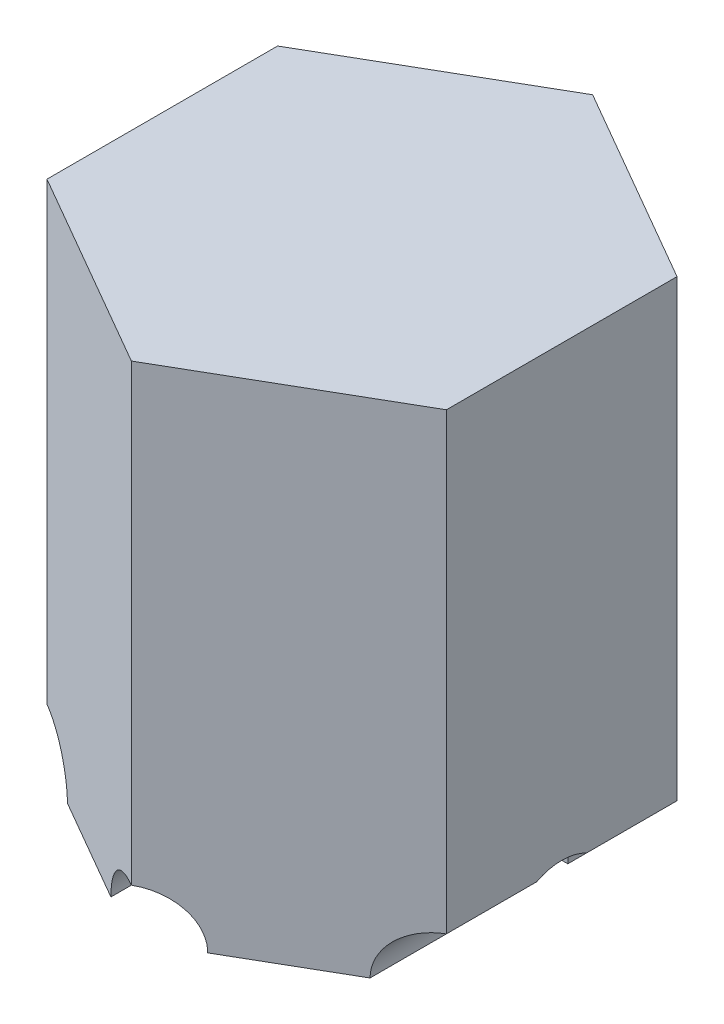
ISO-10303-21;
HEADER;
FILE_DESCRIPTION(('STEP AP214'),'2;1');
FILE_NAME('part.step','',(''),(''),'','','');
FILE_SCHEMA(('AUTOMOTIVE_DESIGN { 1 0 10303 214 1 1 1 1 }'));
ENDSEC;
DATA;
#1=APPLICATION_CONTEXT('core data for automotive mechanical design processes');
#2=APPLICATION_PROTOCOL_DEFINITION('international standard','automotive_design',2000,#1);
#3=PRODUCT_CONTEXT('',#1,'mechanical');
#4=PRODUCT('Part','Part','',(#3));
#5=PRODUCT_RELATED_PRODUCT_CATEGORY('part','',(#4));
#6=PRODUCT_DEFINITION_FORMATION('','',#4);
#7=PRODUCT_DEFINITION_CONTEXT('part definition',#1,'design');
#8=PRODUCT_DEFINITION('design','',#6,#7);
#9=PRODUCT_DEFINITION_SHAPE('','',#8);
#10=(LENGTH_UNIT() NAMED_UNIT(*) SI_UNIT(.MILLI.,.METRE.));
#11=(NAMED_UNIT(*) PLANE_ANGLE_UNIT() SI_UNIT($,.RADIAN.));
#12=(NAMED_UNIT(*) SI_UNIT($,.STERADIAN.) SOLID_ANGLE_UNIT());
#13=UNCERTAINTY_MEASURE_WITH_UNIT(LENGTH_MEASURE(1.E-05),#10,'distance_accuracy_value','');
#14=(GEOMETRIC_REPRESENTATION_CONTEXT(3) GLOBAL_UNCERTAINTY_ASSIGNED_CONTEXT((#13)) GLOBAL_UNIT_ASSIGNED_CONTEXT((#10,
#11,#12)) REPRESENTATION_CONTEXT('',''));
#15=CARTESIAN_POINT('',(0.,0.,0.));
#16=DIRECTION('',(0.,0.,1.));
#17=DIRECTION('',(1.,0.,0.));
#18=AXIS2_PLACEMENT_3D('',#15,#16,#17);
#19=CARTESIAN_POINT('',(-10.1003755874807,-1.651,0.));
#20=DIRECTION('',(0.,1.,0.));
#21=DIRECTION('',(0.,0.,1.));
#22=AXIS2_PLACEMENT_3D('',#19,#20,#21);
#23=PLANE('',#22);
#24=DIRECTION('',(0.,0.,1.));
#25=VECTOR('',#24,1.);
#26=CARTESIAN_POINT('',(-1.016,-1.651,-4.83934995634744));
#27=LINE('',#26,#25);
#28=CARTESIAN_POINT('',(-1.016,-1.651,-4.25276208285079));
#29=VERTEX_POINT('',#28);
#30=CARTESIAN_POINT('',(-1.016,-1.651,-3.00805069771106));
#31=VERTEX_POINT('',#30);
#32=EDGE_CURVE('E871',#29,#31,#27,.T.);
#33=ORIENTED_EDGE('',*,*,#32,.T.);
#34=CARTESIAN_POINT('',(0.,-1.651,0.));
#35=DIRECTION('',(0.,1.,0.));
#36=DIRECTION('',(0.,0.,1.));
#37=AXIS2_PLACEMENT_3D('',#34,#35,#36);
#38=CIRCLE('',#37,3.175);
#39=CARTESIAN_POINT('',(-1.18234513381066,-1.651,-2.94663960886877));
#40=VERTEX_POINT('',#39);
#41=EDGE_CURVE('E723',#31,#40,#38,.T.);
#42=ORIENTED_EDGE('',*,*,#41,.T.);
#43=CARTESIAN_POINT('',(-1.59972901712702,-1.651,-1.59570779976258));
#44=DIRECTION('',(0.,1.,0.));
#45=DIRECTION('',(0.,0.,1.));
#46=AXIS2_PLACEMENT_3D('',#43,#44,#45);
#47=CIRCLE('',#46,1.41393990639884);
#48=CARTESIAN_POINT('',(-2.94960605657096,-1.651,-1.17492515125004));
#49=VERTEX_POINT('',#48);
#50=EDGE_CURVE('E659',#40,#49,#47,.T.);
#51=ORIENTED_EDGE('',*,*,#50,.T.);
#52=CARTESIAN_POINT('',(-2.96212356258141,-1.651,-1.143));
#53=VERTEX_POINT('',#52);
#54=EDGE_CURVE('E715',#49,#53,#38,.T.);
#55=ORIENTED_EDGE('',*,*,#54,.T.);
#56=DIRECTION('',(1.,0.,0.));
#57=VECTOR('',#56,1.);
#58=CARTESIAN_POINT('',(-4.191,-1.651,-1.143));
#59=LINE('',#58,#57);
#60=CARTESIAN_POINT('',(-3.175,-1.651,-1.143));
#61=VERTEX_POINT('',#60);
#62=EDGE_CURVE('E689',#61,#53,#59,.T.);
#63=ORIENTED_EDGE('',*,*,#62,.F.);
#64=DIRECTION('',(0.,0.,-1.));
#65=VECTOR('',#64,1.);
#66=CARTESIAN_POINT('',(-3.175,-1.651,22.2159174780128));
#67=LINE('',#66,#65);
#68=CARTESIAN_POINT('',(-3.175,-1.651,-3.00626285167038));
#69=VERTEX_POINT('',#68);
#70=EDGE_CURVE('E817',#61,#69,#67,.T.);
#71=ORIENTED_EDGE('',*,*,#70,.T.);
#72=DIRECTION('',(-0.866025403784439,0.,0.5));
#73=VECTOR('',#72,1.);
#74=CARTESIAN_POINT('',(-9.6707816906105,-1.651,0.744078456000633));
#75=LINE('',#74,#73);
#76=EDGE_CURVE('E350',#29,#69,#75,.T.);
#77=ORIENTED_EDGE('',*,*,#76,.F.);
#78=EDGE_LOOP('',(#33,#42,#51,#55,#63,#71,#77));
#79=FACE_BOUND('',#78,.T.);
#80=ADVANCED_FACE('F125',(#79),#23,.F.);
#81=DIRECTION('',(0.,0.,1.));
#82=VECTOR('',#81,1.);
#83=CARTESIAN_POINT('',(1.016,-1.651,-4.83934995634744));
#84=LINE('',#83,#82);
#85=CARTESIAN_POINT('',(1.016,-1.651,-4.25276208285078));
#86=VERTEX_POINT('',#85);
#87=CARTESIAN_POINT('',(1.016,-1.651,-3.00805069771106));
#88=VERTEX_POINT('',#87);
#89=EDGE_CURVE('E145',#86,#88,#84,.T.);
#90=ORIENTED_EDGE('',*,*,#89,.F.);
#91=DIRECTION('',(-0.866025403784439,0.,-0.5));
#92=VECTOR('',#91,1.);
#93=CARTESIAN_POINT('',(-5.47978169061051,-1.651,-8.0031033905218));
#94=LINE('',#93,#92);
#95=CARTESIAN_POINT('',(3.175,-1.651,-3.00626285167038));
#96=VERTEX_POINT('',#95);
#97=EDGE_CURVE('E339',#96,#86,#94,.T.);
#98=ORIENTED_EDGE('',*,*,#97,.F.);
#99=DIRECTION('',(0.,0.,1.));
#100=VECTOR('',#99,1.);
#101=CARTESIAN_POINT('',(3.175,-1.651,-4.83934995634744));
#102=LINE('',#101,#100);
#103=CARTESIAN_POINT('',(3.175,-1.651,-1.143));
#104=VERTEX_POINT('',#103);
#105=EDGE_CURVE('E781',#96,#104,#102,.T.);
#106=ORIENTED_EDGE('',*,*,#105,.T.);
#107=CARTESIAN_POINT('',(2.96212356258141,-1.651,-1.143));
#108=VERTEX_POINT('',#107);
#109=EDGE_CURVE('E690',#108,#104,#59,.T.);
#110=ORIENTED_EDGE('',*,*,#109,.F.);
#111=CARTESIAN_POINT('',(2.94663960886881,-1.651,-1.18234513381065));
#112=VERTEX_POINT('',#111);
#113=EDGE_CURVE('E351',#108,#112,#38,.T.);
#114=ORIENTED_EDGE('',*,*,#113,.T.);
#115=CARTESIAN_POINT('',(1.59570779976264,-1.651,-1.59972901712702));
#116=DIRECTION('',(0.,1.,0.));
#117=DIRECTION('',(0.,0.,1.));
#118=AXIS2_PLACEMENT_3D('',#115,#116,#117);
#119=CIRCLE('',#118,1.41393990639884);
#120=CARTESIAN_POINT('',(1.17492515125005,-1.651,-2.94960605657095));
#121=VERTEX_POINT('',#120);
#122=EDGE_CURVE('E676',#112,#121,#119,.T.);
#123=ORIENTED_EDGE('',*,*,#122,.T.);
#124=EDGE_CURVE('E342',#121,#88,#38,.T.);
#125=ORIENTED_EDGE('',*,*,#124,.T.);
#126=EDGE_LOOP('',(#90,#98,#106,#110,#114,#123,#125));
#127=FACE_BOUND('',#126,.T.);
#128=ADVANCED_FACE('F337',(#127),#23,.F.);
#129=CARTESIAN_POINT('',(-1.016,-1.651,3.00805069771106));
#130=VERTEX_POINT('',#129);
#131=CARTESIAN_POINT('',(-1.016,-1.651,4.25276208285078));
#132=VERTEX_POINT('',#131);
#133=EDGE_CURVE('E153',#130,#132,#27,.T.);
#134=ORIENTED_EDGE('',*,*,#133,.T.);
#135=DIRECTION('',(0.866025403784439,0.,0.5));
#136=VECTOR('',#135,1.);
#137=CARTESIAN_POINT('',(-9.6707816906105,-1.651,-0.744078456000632));
#138=LINE('',#137,#136);
#139=CARTESIAN_POINT('',(-3.175,-1.651,3.00626285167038));
#140=VERTEX_POINT('',#139);
#141=EDGE_CURVE('E353',#140,#132,#138,.T.);
#142=ORIENTED_EDGE('',*,*,#141,.F.);
#143=CARTESIAN_POINT('',(-3.175,-1.651,1.143));
#144=VERTEX_POINT('',#143);
#145=EDGE_CURVE('E822',#140,#144,#67,.T.);
#146=ORIENTED_EDGE('',*,*,#145,.T.);
#147=DIRECTION('',(1.,0.,0.));
#148=VECTOR('',#147,1.);
#149=CARTESIAN_POINT('',(-4.191,-1.651,1.143));
#150=LINE('',#149,#148);
#151=CARTESIAN_POINT('',(-2.96212356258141,-1.651,1.143));
#152=VERTEX_POINT('',#151);
#153=EDGE_CURVE('E691',#144,#152,#150,.T.);
#154=ORIENTED_EDGE('',*,*,#153,.T.);
#155=CARTESIAN_POINT('',(-2.94663960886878,-1.651,1.18234513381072));
#156=VERTEX_POINT('',#155);
#157=EDGE_CURVE('E357',#152,#156,#38,.T.);
#158=ORIENTED_EDGE('',*,*,#157,.T.);
#159=CARTESIAN_POINT('',(-1.59570779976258,-1.651,1.59972901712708));
#160=DIRECTION('',(0.,1.,0.));
#161=DIRECTION('',(0.,0.,1.));
#162=AXIS2_PLACEMENT_3D('',#159,#160,#161);
#163=CIRCLE('',#162,1.41393990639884);
#164=CARTESIAN_POINT('',(-1.17492515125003,-1.651,2.949606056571));
#165=VERTEX_POINT('',#164);
#166=EDGE_CURVE('E678',#156,#165,#163,.T.);
#167=ORIENTED_EDGE('',*,*,#166,.T.);
#168=EDGE_CURVE('E358',#165,#130,#38,.T.);
#169=ORIENTED_EDGE('',*,*,#168,.T.);
#170=EDGE_LOOP('',(#134,#142,#146,#154,#158,#167,#169));
#171=FACE_BOUND('',#170,.T.);
#172=ADVANCED_FACE('F869',(#171),#23,.F.);
#173=CARTESIAN_POINT('',(1.016,-1.651,3.00805069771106));
#174=VERTEX_POINT('',#173);
#175=CARTESIAN_POINT('',(1.016,-1.651,4.25276208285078));
#176=VERTEX_POINT('',#175);
#177=EDGE_CURVE('E344',#174,#176,#84,.T.);
#178=ORIENTED_EDGE('',*,*,#177,.F.);
#179=CARTESIAN_POINT('',(1.18234513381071,-1.651,2.94663960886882));
#180=VERTEX_POINT('',#179);
#181=EDGE_CURVE('E714',#174,#180,#38,.T.);
#182=ORIENTED_EDGE('',*,*,#181,.T.);
#183=CARTESIAN_POINT('',(1.59972901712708,-1.651,1.59570779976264));
#184=DIRECTION('',(0.,1.,0.));
#185=DIRECTION('',(0.,0.,1.));
#186=AXIS2_PLACEMENT_3D('',#183,#184,#185);
#187=CIRCLE('',#186,1.41393990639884);
#188=CARTESIAN_POINT('',(2.94960605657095,-1.651,1.17492515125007));
#189=VERTEX_POINT('',#188);
#190=EDGE_CURVE('E673',#180,#189,#187,.T.);
#191=ORIENTED_EDGE('',*,*,#190,.T.);
#192=CARTESIAN_POINT('',(2.96212356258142,-1.651,1.143));
#193=VERTEX_POINT('',#192);
#194=EDGE_CURVE('E706',#189,#193,#38,.T.);
#195=ORIENTED_EDGE('',*,*,#194,.T.);
#196=CARTESIAN_POINT('',(3.175,-1.651,1.143));
#197=VERTEX_POINT('',#196);
#198=EDGE_CURVE('E684',#193,#197,#150,.T.);
#199=ORIENTED_EDGE('',*,*,#198,.T.);
#200=CARTESIAN_POINT('',(3.175,-1.651,3.00626285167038));
#201=VERTEX_POINT('',#200);
#202=EDGE_CURVE('E704',#197,#201,#102,.T.);
#203=ORIENTED_EDGE('',*,*,#202,.T.);
#204=DIRECTION('',(0.866025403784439,0.,-0.5));
#205=VECTOR('',#204,1.);
#206=CARTESIAN_POINT('',(-5.4797816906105,-1.651,8.0031033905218));
#207=LINE('',#206,#205);
#208=EDGE_CURVE('E363',#176,#201,#207,.T.);
#209=ORIENTED_EDGE('',*,*,#208,.F.);
#210=EDGE_LOOP('',(#178,#182,#191,#195,#199,#203,#209));
#211=FACE_BOUND('',#210,.T.);
#212=ADVANCED_FACE('F702',(#211),#23,.F.);
#213=CARTESIAN_POINT('',(-9.6707816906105,8.89,0.744078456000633));
#214=DIRECTION('',(0.5,0.,0.866025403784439));
#215=DIRECTION('',(0.866025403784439,0.,-0.5));
#216=AXIS2_PLACEMENT_3D('',#213,#214,#215);
#217=PLANE('',#216);
#218=CARTESIAN_POINT('',(0.,-1.651,-4.83934995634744));
#219=DIRECTION('',(0.5,0.,0.866025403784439));
#220=DIRECTION('',(-0.866025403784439,0.,0.5));
#221=AXIS2_PLACEMENT_3D('',#218,#219,#220);
#222=ELLIPSE('',#221,1.17317574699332,1.016);
#223=CARTESIAN_POINT('',(0.,-0.635,-4.83934995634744));
#224=VERTEX_POINT('',#223);
#225=EDGE_CURVE('E327',#29,#224,#222,.F.);
#226=ORIENTED_EDGE('',*,*,#225,.F.);
#227=ORIENTED_EDGE('',*,*,#76,.T.);
#228=CARTESIAN_POINT('',(-4.20110481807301,-1.67816979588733,-2.41384095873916));
#229=DIRECTION('',(0.5,0.,0.866025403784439));
#230=DIRECTION('',(0.866025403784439,0.,-0.5));
#231=AXIS2_PLACEMENT_3D('',#228,#229,#230);
#232=ELLIPSE('',#231,1.18525906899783,1.02646446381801);
#233=CARTESIAN_POINT('',(-4.191,-0.651755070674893,-2.41967497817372));
#234=VERTEX_POINT('',#233);
#235=EDGE_CURVE('E799',#234,#69,#232,.F.);
#236=ORIENTED_EDGE('',*,*,#235,.F.);
#237=DIRECTION('',(0.,-1.,0.));
#238=VECTOR('',#237,1.);
#239=CARTESIAN_POINT('',(-4.191,8.89,-2.41967497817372));
#240=LINE('',#239,#238);
#241=CARTESIAN_POINT('',(-4.191,8.89,-2.41967497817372));
#242=VERTEX_POINT('',#241);
#243=EDGE_CURVE('E395',#242,#234,#240,.T.);
#244=ORIENTED_EDGE('',*,*,#243,.F.);
#245=DIRECTION('',(-0.866025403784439,0.,0.5));
#246=VECTOR('',#245,1.);
#247=CARTESIAN_POINT('',(-9.6707816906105,8.89,0.744078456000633));
#248=LINE('',#247,#246);
#249=CARTESIAN_POINT('',(0.,8.89,-4.83934995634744));
#250=VERTEX_POINT('',#249);
#251=EDGE_CURVE('E378',#250,#242,#248,.T.);
#252=ORIENTED_EDGE('',*,*,#251,.F.);
#253=DIRECTION('',(0.,-1.,0.));
#254=VECTOR('',#253,1.);
#255=CARTESIAN_POINT('',(0.,8.89,-4.83934995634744));
#256=LINE('',#255,#254);
#257=EDGE_CURVE('E398',#250,#224,#256,.T.);
#258=ORIENTED_EDGE('',*,*,#257,.T.);
#259=EDGE_LOOP('',(#226,#227,#236,#244,#252,#258));
#260=FACE_BOUND('',#259,.T.);
#261=ADVANCED_FACE('F873',(#260),#217,.F.);
#262=CARTESIAN_POINT('',(-9.6707816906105,8.89,-0.744078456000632));
#263=DIRECTION('',(0.5,0.,-0.866025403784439));
#264=DIRECTION('',(-0.866025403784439,0.,-0.5));
#265=AXIS2_PLACEMENT_3D('',#262,#263,#264);
#266=PLANE('',#265);
#267=CARTESIAN_POINT('',(0.,-1.651,4.83934995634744));
#268=DIRECTION('',(0.5,0.,-0.866025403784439));
#269=DIRECTION('',(0.866025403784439,0.,0.5));
#270=AXIS2_PLACEMENT_3D('',#267,#268,#269);
#271=ELLIPSE('',#270,1.17317574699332,1.016);
#272=CARTESIAN_POINT('',(0.,-0.635,4.83934995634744));
#273=VERTEX_POINT('',#272);
#274=EDGE_CURVE('E332',#273,#132,#271,.F.);
#275=ORIENTED_EDGE('',*,*,#274,.F.);
#276=DIRECTION('',(0.,-1.,0.));
#277=VECTOR('',#276,1.);
#278=CARTESIAN_POINT('',(0.,8.89,4.83934995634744));
#279=LINE('',#278,#277);
#280=CARTESIAN_POINT('',(0.,8.89,4.83934995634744));
#281=VERTEX_POINT('',#280);
#282=EDGE_CURVE('E389',#281,#273,#279,.T.);
#283=ORIENTED_EDGE('',*,*,#282,.F.);
#284=DIRECTION('',(0.866025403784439,0.,0.5));
#285=VECTOR('',#284,1.);
#286=CARTESIAN_POINT('',(-9.6707816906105,8.89,-0.744078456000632));
#287=LINE('',#286,#285);
#288=CARTESIAN_POINT('',(-4.191,8.89,2.41967497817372));
#289=VERTEX_POINT('',#288);
#290=EDGE_CURVE('E382',#289,#281,#287,.T.);
#291=ORIENTED_EDGE('',*,*,#290,.F.);
#292=DIRECTION('',(0.,-1.,0.));
#293=VECTOR('',#292,1.);
#294=CARTESIAN_POINT('',(-4.191,8.89,2.41967497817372));
#295=LINE('',#294,#293);
#296=CARTESIAN_POINT('',(-4.191,-0.651755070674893,2.41967497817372));
#297=VERTEX_POINT('',#296);
#298=EDGE_CURVE('E392',#289,#297,#295,.T.);
#299=ORIENTED_EDGE('',*,*,#298,.T.);
#300=CARTESIAN_POINT('',(-4.20110481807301,-1.67816979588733,2.41384095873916));
#301=DIRECTION('',(0.5,0.,-0.866025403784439));
#302=DIRECTION('',(-0.866025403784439,0.,-0.5));
#303=AXIS2_PLACEMENT_3D('',#300,#301,#302);
#304=ELLIPSE('',#303,1.18525906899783,1.02646446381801);
#305=EDGE_CURVE('E824',#140,#297,#304,.F.);
#306=ORIENTED_EDGE('',*,*,#305,.F.);
#307=ORIENTED_EDGE('',*,*,#141,.T.);
#308=EDGE_LOOP('',(#275,#283,#291,#299,#306,#307));
#309=FACE_BOUND('',#308,.T.);
#310=ADVANCED_FACE('F837',(#309),#266,.F.);
#311=CARTESIAN_POINT('',(-5.47978169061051,8.89,-8.0031033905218));
#312=DIRECTION('',(-0.5,0.,0.866025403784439));
#313=DIRECTION('',(0.866025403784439,0.,0.5));
#314=AXIS2_PLACEMENT_3D('',#311,#312,#313);
#315=PLANE('',#314);
#316=CARTESIAN_POINT('',(0.,-1.651,-4.83934995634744));
#317=DIRECTION('',(-0.5,0.,0.866025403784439));
#318=DIRECTION('',(0.866025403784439,0.,0.5));
#319=AXIS2_PLACEMENT_3D('',#316,#317,#318);
#320=ELLIPSE('',#319,1.17317574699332,1.016);
#321=EDGE_CURVE('E324',#224,#86,#320,.F.);
#322=ORIENTED_EDGE('',*,*,#321,.F.);
#323=ORIENTED_EDGE('',*,*,#257,.F.);
#324=DIRECTION('',(-0.866025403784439,0.,-0.5));
#325=VECTOR('',#324,1.);
#326=CARTESIAN_POINT('',(-5.47978169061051,8.89,-8.0031033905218));
#327=LINE('',#326,#325);
#328=CARTESIAN_POINT('',(4.191,8.89,-2.41967497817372));
#329=VERTEX_POINT('',#328);
#330=EDGE_CURVE('E376',#329,#250,#327,.T.);
#331=ORIENTED_EDGE('',*,*,#330,.F.);
#332=DIRECTION('',(0.,-1.,0.));
#333=VECTOR('',#332,1.);
#334=CARTESIAN_POINT('',(4.191,8.89,-2.41967497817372));
#335=LINE('',#334,#333);
#336=CARTESIAN_POINT('',(4.191,-0.635,-2.41967497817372));
#337=VERTEX_POINT('',#336);
#338=EDGE_CURVE('E400',#329,#337,#335,.T.);
#339=ORIENTED_EDGE('',*,*,#338,.T.);
#340=CARTESIAN_POINT('',(4.191,-1.651,-2.41967497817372));
#341=DIRECTION('',(-0.5,0.,0.866025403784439));
#342=DIRECTION('',(0.866025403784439,0.,0.5));
#343=AXIS2_PLACEMENT_3D('',#340,#341,#342);
#344=ELLIPSE('',#343,1.17317574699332,1.016);
#345=EDGE_CURVE('E349',#96,#337,#344,.F.);
#346=ORIENTED_EDGE('',*,*,#345,.F.);
#347=ORIENTED_EDGE('',*,*,#97,.T.);
#348=EDGE_LOOP('',(#322,#323,#331,#339,#346,#347));
#349=FACE_BOUND('',#348,.T.);
#350=ADVANCED_FACE('F347',(#349),#315,.F.);
#351=CARTESIAN_POINT('',(-5.4797816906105,8.89,8.0031033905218));
#352=DIRECTION('',(-0.5,0.,-0.866025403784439));
#353=DIRECTION('',(-0.866025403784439,0.,0.5));
#354=AXIS2_PLACEMENT_3D('',#351,#352,#353);
#355=PLANE('',#354);
#356=CARTESIAN_POINT('',(0.,-1.651,4.83934995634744));
#357=DIRECTION('',(-0.5,0.,-0.866025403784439));
#358=DIRECTION('',(-0.866025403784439,0.,0.5));
#359=AXIS2_PLACEMENT_3D('',#356,#357,#358);
#360=ELLIPSE('',#359,1.17317574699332,1.016);
#361=EDGE_CURVE('E806',#176,#273,#360,.F.);
#362=ORIENTED_EDGE('',*,*,#361,.F.);
#363=ORIENTED_EDGE('',*,*,#208,.T.);
#364=CARTESIAN_POINT('',(4.191,-1.651,2.41967497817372));
#365=DIRECTION('',(-0.5,0.,-0.866025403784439));
#366=DIRECTION('',(-0.866025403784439,0.,0.5));
#367=AXIS2_PLACEMENT_3D('',#364,#365,#366);
#368=ELLIPSE('',#367,1.17317574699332,1.016);
#369=CARTESIAN_POINT('',(4.191,-0.635,2.41967497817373));
#370=VERTEX_POINT('',#369);
#371=EDGE_CURVE('E796',#370,#201,#368,.F.);
#372=ORIENTED_EDGE('',*,*,#371,.F.);
#373=DIRECTION('',(0.,-1.,0.));
#374=VECTOR('',#373,1.);
#375=CARTESIAN_POINT('',(4.191,8.89,2.41967497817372));
#376=LINE('',#375,#374);
#377=CARTESIAN_POINT('',(4.191,8.89,2.41967497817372));
#378=VERTEX_POINT('',#377);
#379=EDGE_CURVE('E386',#378,#370,#376,.T.);
#380=ORIENTED_EDGE('',*,*,#379,.F.);
#381=DIRECTION('',(0.866025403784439,0.,-0.5));
#382=VECTOR('',#381,1.);
#383=CARTESIAN_POINT('',(-5.4797816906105,8.89,8.0031033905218));
#384=LINE('',#383,#382);
#385=EDGE_CURVE('E384',#281,#378,#384,.T.);
#386=ORIENTED_EDGE('',*,*,#385,.F.);
#387=ORIENTED_EDGE('',*,*,#282,.T.);
#388=EDGE_LOOP('',(#362,#363,#372,#380,#386,#387));
#389=FACE_BOUND('',#388,.T.);
#390=ADVANCED_FACE('F804',(#389),#355,.F.);
#391=CARTESIAN_POINT('',(0.,1.651,0.));
#392=DIRECTION('',(0.,-1.,0.));
#393=DIRECTION('',(0.,0.,-1.));
#394=AXIS2_PLACEMENT_3D('',#391,#392,#393);
#395=CYLINDRICAL_SURFACE('',#394,3.175);
#396=ORIENTED_EDGE('',*,*,#41,.F.);
#397=CARTESIAN_POINT('',(-1.016,-1.651,-3.00805069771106));
#398=CARTESIAN_POINT('',(-1.01600068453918,-1.62320463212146,-3.0080481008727));
#399=CARTESIAN_POINT('',(-1.01485864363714,-1.59542337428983,-3.00843644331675));
#400=CARTESIAN_POINT('',(-1.01030830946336,-1.54007493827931,-3.00996856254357));
#401=CARTESIAN_POINT('',(-1.00690058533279,-1.51250770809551,-3.01111214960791));
#402=CARTESIAN_POINT('',(-0.99333994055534,-1.43058490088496,-3.0156254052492));
#403=CARTESIAN_POINT('',(-0.979849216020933,-1.37680239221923,-3.02007795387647));
#404=CARTESIAN_POINT('',(-0.944444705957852,-1.27242130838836,-3.0313345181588));
#405=CARTESIAN_POINT('',(-0.922534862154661,-1.22182125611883,-3.03813743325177));
#406=CARTESIAN_POINT('',(-0.87095549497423,-1.12497387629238,-3.05332317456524));
#407=CARTESIAN_POINT('',(-0.841281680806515,-1.0787289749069,-3.06170687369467));
#408=CARTESIAN_POINT('',(-0.773882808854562,-0.990278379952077,-3.07944486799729));
#409=CARTESIAN_POINT('',(-0.73592751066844,-0.948252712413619,-3.08882184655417));
#410=CARTESIAN_POINT('',(-0.653533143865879,-0.871039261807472,-3.10729783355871));
#411=CARTESIAN_POINT('',(-0.609092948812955,-0.835852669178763,-3.11639679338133));
#412=CARTESIAN_POINT('',(-0.513681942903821,-0.772511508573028,-3.13355341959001));
#413=CARTESIAN_POINT('',(-0.46258071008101,-0.744544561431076,-3.14158109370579));
#414=CARTESIAN_POINT('',(-0.35610089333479,-0.697674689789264,-3.15542299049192));
#415=CARTESIAN_POINT('',(-0.300723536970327,-0.678769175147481,-3.1612378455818));
#416=CARTESIAN_POINT('',(-0.189157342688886,-0.651164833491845,-3.16983790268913));
#417=CARTESIAN_POINT('',(-0.133052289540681,-0.642156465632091,-3.17271477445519));
#418=CARTESIAN_POINT('',(-0.0200570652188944,-0.633620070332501,-3.17543909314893));
#419=CARTESIAN_POINT('',(0.0368329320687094,-0.634089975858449,-3.17528720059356));
#420=CARTESIAN_POINT('',(0.147598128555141,-0.64429611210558,-3.17203421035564));
#421=CARTESIAN_POINT('',(0.201507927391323,-0.65369641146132,-3.16904003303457));
#422=CARTESIAN_POINT('',(0.30693947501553,-0.680943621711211,-3.16057142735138));
#423=CARTESIAN_POINT('',(0.358461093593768,-0.698790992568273,-3.15509686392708));
#424=CARTESIAN_POINT('',(0.458415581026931,-0.742634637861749,-3.14214165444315));
#425=CARTESIAN_POINT('',(0.506801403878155,-0.768730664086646,-3.13463662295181));
#426=CARTESIAN_POINT('',(0.598609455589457,-0.828250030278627,-3.11840798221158));
#427=CARTESIAN_POINT('',(0.64203042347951,-0.861675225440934,-3.10968406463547));
#428=CARTESIAN_POINT('',(0.724674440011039,-0.93661355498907,-3.09149495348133));
#429=CARTESIAN_POINT('',(0.763632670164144,-0.978415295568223,-3.08201402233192));
#430=CARTESIAN_POINT('',(0.834074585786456,-1.06805472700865,-3.06370249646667));
#431=CARTESIAN_POINT('',(0.865555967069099,-1.11589427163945,-3.05487210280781));
#432=CARTESIAN_POINT('',(0.920483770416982,-1.2170409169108,-3.03877723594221));
#433=CARTESIAN_POINT('',(0.943822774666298,-1.27040988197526,-3.03153413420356));
#434=CARTESIAN_POINT('',(0.981069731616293,-1.38058100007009,-3.01968795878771));
#435=CARTESIAN_POINT('',(0.994992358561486,-1.43737766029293,-3.01508077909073));
#436=CARTESIAN_POINT('',(1.0079586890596,-1.52076650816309,-3.01075715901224));
#437=CARTESIAN_POINT('',(1.01097332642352,-1.54672859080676,-3.0097448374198));
#438=CARTESIAN_POINT('',(1.0149924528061,-1.59878925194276,-3.00839130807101));
#439=CARTESIAN_POINT('',(1.0159996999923,-1.62488759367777,-3.00804917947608));
#440=CARTESIAN_POINT('',(1.016,-1.651,-3.00805069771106));
#441=B_SPLINE_CURVE_WITH_KNOTS('',3,(#397,#398,#399,#400,#401,#402,#403,#404,#405,#406,#407,
#408,#409,#410,#411,#412,#413,#414,#415,#416,#417,#418,#419,#420,#421,#422,#423,#424,#425,#426,
#427,#428,#429,#430,#431,#432,#433,#434,#435,#436,#437,#438,#439,#440),.UNSPECIFIED.,.F.,.F.,(4,
2,2,2,2,2,2,2,2,2,2,2,2,2,2,2,2,2,2,2,2,4),(0.,0.0833323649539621,0.166643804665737,
0.332657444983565,0.498593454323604,0.664621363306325,0.836042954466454,1.00749435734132,
1.18303275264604,1.35852094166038,1.52834889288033,1.6981398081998,1.86178658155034,
2.02544226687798,2.19115808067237,2.35691588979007,2.52988511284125,2.70290757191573,
2.8781332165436,3.05308516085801,3.13148083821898,3.20976872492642),.UNSPECIFIED.);
#442=EDGE_CURVE('E343',#31,#88,#441,.T.);
#443=ORIENTED_EDGE('',*,*,#442,.T.);
#444=ORIENTED_EDGE('',*,*,#124,.F.);
#445=DIRECTION('',(0.,-1.,0.));
#446=VECTOR('',#445,1.);
#447=CARTESIAN_POINT('',(1.17492515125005,0.889,-2.94960605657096));
#448=LINE('',#447,#446);
#449=CARTESIAN_POINT('',(1.17492515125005,0.889,-2.94960605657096));
#450=VERTEX_POINT('',#449);
#451=EDGE_CURVE('E675',#450,#121,#448,.T.);
#452=ORIENTED_EDGE('',*,*,#451,.F.);
#453=DIRECTION('',(0.,1.,0.));
#454=VECTOR('',#453,1.);
#455=CARTESIAN_POINT('',(1.17492515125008,1.27,-2.94960605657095));
#456=LINE('',#455,#454);
#457=CARTESIAN_POINT('',(1.1749251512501,1.651,-2.94960605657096));
#458=VERTEX_POINT('',#457);
#459=EDGE_CURVE('E525',#450,#458,#456,.T.);
#460=ORIENTED_EDGE('',*,*,#459,.T.);
#461=CARTESIAN_POINT('',(0.,1.651,0.));
#462=DIRECTION('',(0.,1.,0.));
#463=DIRECTION('',(0.,0.,1.));
#464=AXIS2_PLACEMENT_3D('',#461,#462,#463);
#465=CIRCLE('',#464,3.175);
#466=CARTESIAN_POINT('',(-1.18234513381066,1.651,-2.94663960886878));
#467=VERTEX_POINT('',#466);
#468=EDGE_CURVE('E617',#458,#467,#465,.T.);
#469=ORIENTED_EDGE('',*,*,#468,.T.);
#470=DIRECTION('',(0.,1.,0.));
#471=VECTOR('',#470,1.);
#472=CARTESIAN_POINT('',(-1.18234513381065,0.889,-2.94663960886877));
#473=LINE('',#472,#471);
#474=CARTESIAN_POINT('',(-1.18234513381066,0.889,-2.94663960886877));
#475=VERTEX_POINT('',#474);
#476=EDGE_CURVE('E510',#475,#467,#473,.T.);
#477=ORIENTED_EDGE('',*,*,#476,.F.);
#478=DIRECTION('',(0.,-1.,0.));
#479=VECTOR('',#478,1.);
#480=CARTESIAN_POINT('',(-1.18234513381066,0.889,-2.94663960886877));
#481=LINE('',#480,#479);
#482=EDGE_CURVE('E629',#475,#40,#481,.T.);
#483=ORIENTED_EDGE('',*,*,#482,.T.);
#484=EDGE_LOOP('',(#396,#443,#444,#452,#460,#469,#477,#483));
#485=FACE_BOUND('',#484,.T.);
#486=ADVANCED_FACE('F606',(#485),#395,.F.);
#487=ORIENTED_EDGE('',*,*,#181,.F.);
#488=CARTESIAN_POINT('',(1.016,-1.651,3.00805069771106));
#489=CARTESIAN_POINT('',(1.01600068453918,-1.62320463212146,3.0080481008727));
#490=CARTESIAN_POINT('',(1.01485864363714,-1.59542337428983,3.00843644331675));
#491=CARTESIAN_POINT('',(1.01030830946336,-1.54007493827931,3.00996856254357));
#492=CARTESIAN_POINT('',(1.00690058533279,-1.51250770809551,3.01111214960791));
#493=CARTESIAN_POINT('',(0.99333994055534,-1.43058490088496,3.0156254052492));
#494=CARTESIAN_POINT('',(0.979849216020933,-1.37680239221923,3.02007795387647));
#495=CARTESIAN_POINT('',(0.944444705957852,-1.27242130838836,3.0313345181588));
#496=CARTESIAN_POINT('',(0.922534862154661,-1.22182125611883,3.03813743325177));
#497=CARTESIAN_POINT('',(0.87095549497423,-1.12497387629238,3.05332317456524));
#498=CARTESIAN_POINT('',(0.841281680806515,-1.0787289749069,3.06170687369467));
#499=CARTESIAN_POINT('',(0.773882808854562,-0.990278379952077,3.07944486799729));
#500=CARTESIAN_POINT('',(0.73592751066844,-0.948252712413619,3.08882184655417));
#501=CARTESIAN_POINT('',(0.653533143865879,-0.871039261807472,3.10729783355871));
#502=CARTESIAN_POINT('',(0.609092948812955,-0.835852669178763,3.11639679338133));
#503=CARTESIAN_POINT('',(0.513681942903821,-0.772511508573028,3.13355341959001));
#504=CARTESIAN_POINT('',(0.46258071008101,-0.744544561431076,3.14158109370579));
#505=CARTESIAN_POINT('',(0.35610089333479,-0.697674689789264,3.15542299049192));
#506=CARTESIAN_POINT('',(0.300723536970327,-0.678769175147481,3.1612378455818));
#507=CARTESIAN_POINT('',(0.189157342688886,-0.651164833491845,3.16983790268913));
#508=CARTESIAN_POINT('',(0.133052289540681,-0.642156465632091,3.17271477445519));
#509=CARTESIAN_POINT('',(0.0200570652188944,-0.633620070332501,3.17543909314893));
#510=CARTESIAN_POINT('',(-0.0368329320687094,-0.634089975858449,3.17528720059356));
#511=CARTESIAN_POINT('',(-0.147598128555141,-0.64429611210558,3.17203421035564));
#512=CARTESIAN_POINT('',(-0.201507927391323,-0.65369641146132,3.16904003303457));
#513=CARTESIAN_POINT('',(-0.30693947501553,-0.680943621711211,3.16057142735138));
#514=CARTESIAN_POINT('',(-0.358461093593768,-0.698790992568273,3.15509686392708));
#515=CARTESIAN_POINT('',(-0.458415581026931,-0.742634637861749,3.14214165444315));
#516=CARTESIAN_POINT('',(-0.506801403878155,-0.768730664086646,3.13463662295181));
#517=CARTESIAN_POINT('',(-0.598609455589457,-0.828250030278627,3.11840798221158));
#518=CARTESIAN_POINT('',(-0.64203042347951,-0.861675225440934,3.10968406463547));
#519=CARTESIAN_POINT('',(-0.724674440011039,-0.93661355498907,3.09149495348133));
#520=CARTESIAN_POINT('',(-0.763632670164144,-0.978415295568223,3.08201402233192));
#521=CARTESIAN_POINT('',(-0.834074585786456,-1.06805472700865,3.06370249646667));
#522=CARTESIAN_POINT('',(-0.865555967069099,-1.11589427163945,3.05487210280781));
#523=CARTESIAN_POINT('',(-0.920483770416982,-1.2170409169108,3.03877723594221));
#524=CARTESIAN_POINT('',(-0.943822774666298,-1.27040988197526,3.03153413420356));
#525=CARTESIAN_POINT('',(-0.981069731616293,-1.38058100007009,3.01968795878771));
#526=CARTESIAN_POINT('',(-0.994992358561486,-1.43737766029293,3.01508077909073));
#527=CARTESIAN_POINT('',(-1.0079586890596,-1.52076650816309,3.01075715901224));
#528=CARTESIAN_POINT('',(-1.01097332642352,-1.54672859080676,3.0097448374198));
#529=CARTESIAN_POINT('',(-1.0149924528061,-1.59878925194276,3.00839130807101));
#530=CARTESIAN_POINT('',(-1.0159996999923,-1.62488759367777,3.00804917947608));
#531=CARTESIAN_POINT('',(-1.016,-1.651,3.00805069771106));
#532=B_SPLINE_CURVE_WITH_KNOTS('',3,(#488,#489,#490,#491,#492,#493,#494,#495,#496,#497,#498,
#499,#500,#501,#502,#503,#504,#505,#506,#507,#508,#509,#510,#511,#512,#513,#514,#515,#516,#517,
#518,#519,#520,#521,#522,#523,#524,#525,#526,#527,#528,#529,#530,#531),.UNSPECIFIED.,.F.,.F.,(4,
2,2,2,2,2,2,2,2,2,2,2,2,2,2,2,2,2,2,2,2,4),(0.,0.0833323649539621,0.166643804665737,
0.332657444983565,0.498593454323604,0.664621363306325,0.836042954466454,1.00749435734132,
1.18303275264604,1.35852094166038,1.52834889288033,1.6981398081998,1.86178658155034,
2.02544226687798,2.19115808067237,2.35691588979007,2.52988511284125,2.70290757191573,
2.8781332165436,3.05308516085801,3.13148083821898,3.20976872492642),.UNSPECIFIED.);
#533=EDGE_CURVE('E12',#174,#130,#532,.T.);
#534=ORIENTED_EDGE('',*,*,#533,.T.);
#535=ORIENTED_EDGE('',*,*,#168,.F.);
#536=DIRECTION('',(0.,-1.,0.));
#537=VECTOR('',#536,1.);
#538=CARTESIAN_POINT('',(-1.17492515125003,0.889,2.949606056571));
#539=LINE('',#538,#537);
#540=CARTESIAN_POINT('',(-1.17492515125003,0.889,2.949606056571));
#541=VERTEX_POINT('',#540);
#542=EDGE_CURVE('E688',#541,#165,#539,.T.);
#543=ORIENTED_EDGE('',*,*,#542,.F.);
#544=DIRECTION('',(0.,1.,0.));
#545=VECTOR('',#544,1.);
#546=CARTESIAN_POINT('',(-1.17492515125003,0.889,2.949606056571));
#547=LINE('',#546,#545);
#548=CARTESIAN_POINT('',(-1.17492515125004,1.651,2.94960605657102));
#549=VERTEX_POINT('',#548);
#550=EDGE_CURVE('E847',#541,#549,#547,.T.);
#551=ORIENTED_EDGE('',*,*,#550,.T.);
#552=CARTESIAN_POINT('',(1.18234513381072,1.651,2.94663960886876));
#553=VERTEX_POINT('',#552);
#554=EDGE_CURVE('E373',#549,#553,#465,.T.);
#555=ORIENTED_EDGE('',*,*,#554,.T.);
#556=DIRECTION('',(0.,-1.,0.));
#557=VECTOR('',#556,1.);
#558=CARTESIAN_POINT('',(1.18234513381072,1.27,2.94663960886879));
#559=LINE('',#558,#557);
#560=CARTESIAN_POINT('',(1.18234513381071,0.889,2.94663960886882));
#561=VERTEX_POINT('',#560);
#562=EDGE_CURVE('E553',#553,#561,#559,.T.);
#563=ORIENTED_EDGE('',*,*,#562,.T.);
#564=DIRECTION('',(0.,-1.,0.));
#565=VECTOR('',#564,1.);
#566=CARTESIAN_POINT('',(1.18234513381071,0.889,2.94663960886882));
#567=LINE('',#566,#565);
#568=EDGE_CURVE('E649',#561,#180,#567,.T.);
#569=ORIENTED_EDGE('',*,*,#568,.T.);
#570=EDGE_LOOP('',(#487,#534,#535,#543,#551,#555,#563,#569));
#571=FACE_BOUND('',#570,.T.);
#572=ADVANCED_FACE('F730',(#571),#395,.F.);
#573=CARTESIAN_POINT('',(-4.191,8.89,0.));
#574=DIRECTION('',(1.,0.,0.));
#575=DIRECTION('',(0.,0.,-1.));
#576=AXIS2_PLACEMENT_3D('',#573,#574,#575);
#577=PLANE('',#576);
#578=DIRECTION('',(0.,0.,-1.));
#579=VECTOR('',#578,1.);
#580=CARTESIAN_POINT('',(-4.191,-0.651755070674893,22.2159174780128));
#581=LINE('',#580,#579);
#582=CARTESIAN_POINT('',(-4.191,-0.651755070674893,0.55494015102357));
#583=VERTEX_POINT('',#582);
#584=EDGE_CURVE('E821',#297,#583,#581,.T.);
#585=ORIENTED_EDGE('',*,*,#584,.F.);
#586=ORIENTED_EDGE('',*,*,#298,.F.);
#587=DIRECTION('',(0.,0.,1.));
#588=VECTOR('',#587,1.);
#589=CARTESIAN_POINT('',(-4.191,8.89,0.));
#590=LINE('',#589,#588);
#591=EDGE_CURVE('E380',#242,#289,#590,.T.);
#592=ORIENTED_EDGE('',*,*,#591,.F.);
#593=ORIENTED_EDGE('',*,*,#243,.T.);
#594=CARTESIAN_POINT('',(-4.191,-0.651755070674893,-0.55494015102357));
#595=VERTEX_POINT('',#594);
#596=EDGE_CURVE('E818',#595,#234,#581,.T.);
#597=ORIENTED_EDGE('',*,*,#596,.F.);
#598=CARTESIAN_POINT('',(-4.191,-1.651,0.));
#599=DIRECTION('',(1.,0.,0.));
#600=DIRECTION('',(0.,0.,1.));
#601=AXIS2_PLACEMENT_3D('',#598,#599,#600);
#602=CIRCLE('',#601,1.143);
#603=EDGE_CURVE('E681',#595,#583,#602,.T.);
#604=ORIENTED_EDGE('',*,*,#603,.T.);
#605=EDGE_LOOP('',(#585,#586,#592,#593,#597,#604));
#606=FACE_BOUND('',#605,.T.);
#607=ADVANCED_FACE('F433',(#606),#577,.F.);
#608=CARTESIAN_POINT('',(-4.191,-1.651,0.));
#609=DIRECTION('',(1.,0.,0.));
#610=DIRECTION('',(0.,0.,-1.));
#611=AXIS2_PLACEMENT_3D('',#608,#609,#610);
#612=CYLINDRICAL_SURFACE('',#611,1.143);
#613=CARTESIAN_POINT('',(-4.191,-0.651755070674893,0.55494015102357));
#614=CARTESIAN_POINT('',(-4.15656157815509,-0.652061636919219,0.555419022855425));
#615=CARTESIAN_POINT('',(-4.12247797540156,-0.654158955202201,0.559279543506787));
#616=CARTESIAN_POINT('',(-4.05619775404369,-0.661457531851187,0.572124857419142));
#617=CARTESIAN_POINT('',(-4.02397896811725,-0.666605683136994,0.581021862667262));
#618=CARTESIAN_POINT('',(-3.94627142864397,-0.682700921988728,0.607594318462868));
#619=CARTESIAN_POINT('',(-3.90189862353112,-0.69524830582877,0.627434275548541));
#620=CARTESIAN_POINT('',(-3.81656129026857,-0.725373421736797,0.671108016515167));
#621=CARTESIAN_POINT('',(-3.77563632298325,-0.743001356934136,0.694980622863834));
#622=CARTESIAN_POINT('',(-3.67703460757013,-0.793062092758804,0.756748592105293));
#623=CARTESIAN_POINT('',(-3.621445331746,-0.828462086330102,0.795591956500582));
#624=CARTESIAN_POINT('',(-3.51753191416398,-0.909618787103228,0.871727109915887));
#625=CARTESIAN_POINT('',(-3.46918449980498,-0.955341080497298,0.909023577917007));
#626=CARTESIAN_POINT('',(-3.39224773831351,-1.04422733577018,0.969731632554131));
#627=CARTESIAN_POINT('',(-3.36177933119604,-1.08500657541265,0.99424258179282));
#628=CARTESIAN_POINT('',(-3.3064551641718,-1.1723119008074,1.03908880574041));
#629=CARTESIAN_POINT('',(-3.28159364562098,-1.2188320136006,1.05942836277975));
#630=CARTESIAN_POINT('',(-3.24252585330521,-1.30842342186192,1.09130355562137));
#631=CARTESIAN_POINT('',(-3.22721829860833,-1.3506865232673,1.10375525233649));
#632=CARTESIAN_POINT('',(-3.20213609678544,-1.43788601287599,1.12384172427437));
#633=CARTESIAN_POINT('',(-3.19234965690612,-1.48281647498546,1.13148677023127));
#634=CARTESIAN_POINT('',(-3.18263531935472,-1.54867038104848,1.13859328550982));
#635=CARTESIAN_POINT('',(-3.18025212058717,-1.56903426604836,1.14024124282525));
#636=CARTESIAN_POINT('',(-3.1767062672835,-1.60992293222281,1.14244499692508));
#637=CARTESIAN_POINT('',(-3.17554340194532,-1.63044768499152,1.14300098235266));
#638=CARTESIAN_POINT('',(-3.17499999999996,-1.65099999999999,1.14300000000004));
#639=B_SPLINE_CURVE_WITH_KNOTS('',3,(#613,#614,#615,#616,#617,#618,#619,#620,#621,#622,#623,
#624,#625,#626,#627,#628,#629,#630,#631,#632,#633,#634,#635,#636,#637,#638),.UNSPECIFIED.,.F.,
.F.,(4,2,2,2,2,2,2,2,2,2,2,2,4),(0.,0.102697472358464,0.203657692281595,0.353432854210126,
0.504741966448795,0.73313568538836,0.960778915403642,1.12967598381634,1.29839878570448,
1.43776586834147,1.57683413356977,1.63848498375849,1.7001251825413),.UNSPECIFIED.);
#640=EDGE_CURVE('E138',#583,#144,#639,.T.);
#641=ORIENTED_EDGE('',*,*,#640,.F.);
#642=ORIENTED_EDGE('',*,*,#603,.F.);
#643=CARTESIAN_POINT('',(-3.175,-1.651,-1.143));
#644=CARTESIAN_POINT('',(-3.17563511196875,-1.62690070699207,-1.14300329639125));
#645=CARTESIAN_POINT('',(-3.17712550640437,-1.60283914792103,-1.14223716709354));
#646=CARTESIAN_POINT('',(-3.18177522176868,-1.55499127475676,-1.13921218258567));
#647=CARTESIAN_POINT('',(-3.18493321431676,-1.53120475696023,-1.13695451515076));
#648=CARTESIAN_POINT('',(-3.19677786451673,-1.4609263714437,-1.12806541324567));
#649=CARTESIAN_POINT('',(-3.20784842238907,-1.41507293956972,-1.11931605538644));
#650=CARTESIAN_POINT('',(-3.23561631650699,-1.32658333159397,-1.09694450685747));
#651=CARTESIAN_POINT('',(-3.25229787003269,-1.28393853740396,-1.08333597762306));
#652=CARTESIAN_POINT('',(-3.29047306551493,-1.20234076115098,-1.05217233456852));
#653=CARTESIAN_POINT('',(-3.31197672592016,-1.1633957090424,-1.03460900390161));
#654=CARTESIAN_POINT('',(-3.36833794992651,-1.07495528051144,-0.988932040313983));
#655=CARTESIAN_POINT('',(-3.40510707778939,-1.0274137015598,-0.959398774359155));
#656=CARTESIAN_POINT('',(-3.48492806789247,-0.940457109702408,-0.896913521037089));
#657=CARTESIAN_POINT('',(-3.52799573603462,-0.901063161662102,-0.863952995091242));
#658=CARTESIAN_POINT('',(-3.62060673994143,-0.829549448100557,-0.796329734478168));
#659=CARTESIAN_POINT('',(-3.67027271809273,-0.797610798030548,-0.761645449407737));
#660=CARTESIAN_POINT('',(-3.77554554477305,-0.742184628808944,-0.694524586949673));
#661=CARTESIAN_POINT('',(-3.8311397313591,-0.718679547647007,-0.662083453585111));
#662=CARTESIAN_POINT('',(-3.92140358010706,-0.69001269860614,-0.619096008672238));
#663=CARTESIAN_POINT('',(-3.95349579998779,-0.681437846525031,-0.605461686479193));
#664=CARTESIAN_POINT('',(-4.01964034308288,-0.667312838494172,-0.582230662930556));
#665=CARTESIAN_POINT('',(-4.05368018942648,-0.661745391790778,-0.572610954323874));
#666=CARTESIAN_POINT('',(-4.10524746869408,-0.656051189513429,-0.562619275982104));
#667=CARTESIAN_POINT('',(-4.12220956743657,-0.654599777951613,-0.560037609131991));
#668=CARTESIAN_POINT('',(-4.15643482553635,-0.652532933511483,-0.556340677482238));
#669=CARTESIAN_POINT('',(-4.17369911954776,-0.651922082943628,-0.55523345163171));
#670=CARTESIAN_POINT('',(-4.191,-0.651755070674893,-0.55494015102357));
#671=B_SPLINE_CURVE_WITH_KNOTS('',3,(#643,#644,#645,#646,#647,#648,#649,#650,#651,#652,#653,
#654,#655,#656,#657,#658,#659,#660,#661,#662,#663,#664,#665,#666,#667,#668,#669,#670),
.UNSPECIFIED.,.F.,.F.,(4,2,2,2,2,2,2,2,2,2,2,2,2,4),(0.,0.0722674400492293,0.144477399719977,
0.287589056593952,0.430301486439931,0.573313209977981,0.773129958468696,0.973457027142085,
1.1782361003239,1.38258623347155,1.4900423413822,1.59687388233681,1.64845193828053,
1.70031007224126),.UNSPECIFIED.);
#672=EDGE_CURVE('E464',#61,#595,#671,.T.);
#673=ORIENTED_EDGE('',*,*,#672,.F.);
#674=ORIENTED_EDGE('',*,*,#62,.T.);
#675=CARTESIAN_POINT('',(-2.96212356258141,-1.651,-1.143));
#676=CARTESIAN_POINT('',(-2.96212011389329,-1.61997052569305,-1.14300103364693));
#677=CARTESIAN_POINT('',(-2.96261174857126,-1.58895708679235,-1.14173563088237));
#678=CARTESIAN_POINT('',(-2.96455039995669,-1.52717432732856,-1.13669559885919));
#679=CARTESIAN_POINT('',(-2.96599711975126,-1.49640493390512,-1.13292174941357));
#680=CARTESIAN_POINT('',(-2.9717022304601,-1.40500811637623,-1.11791389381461));
#681=CARTESIAN_POINT('',(-2.97732615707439,-1.34502832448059,-1.10299311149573));
#682=CARTESIAN_POINT('',(-2.99152287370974,-1.22864844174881,-1.06388050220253));
#683=CARTESIAN_POINT('',(-3.00009350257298,-1.17224576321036,-1.0396954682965));
#684=CARTESIAN_POINT('',(-3.01921041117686,-1.06424233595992,-0.982798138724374));
#685=CARTESIAN_POINT('',(-3.02975815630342,-1.01264519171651,-0.950079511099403));
#686=CARTESIAN_POINT('',(-3.0521758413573,-0.913411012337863,-0.875456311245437));
#687=CARTESIAN_POINT('',(-3.06408240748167,-0.866025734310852,-0.833228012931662));
#688=CARTESIAN_POINT('',(-3.08756954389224,-0.778832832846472,-0.741471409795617));
#689=CARTESIAN_POINT('',(-3.09915005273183,-0.739026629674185,-0.691941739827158));
#690=CARTESIAN_POINT('',(-3.12111402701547,-0.666929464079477,-0.585092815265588));
#691=CARTESIAN_POINT('',(-3.13144919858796,-0.63491002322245,-0.52757954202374));
#692=CARTESIAN_POINT('',(-3.14931807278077,-0.58110495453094,-0.407547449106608));
#693=CARTESIAN_POINT('',(-3.15685274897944,-0.559315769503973,-0.345030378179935));
#694=CARTESIAN_POINT('',(-3.1680109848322,-0.527464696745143,-0.219421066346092));
#695=CARTESIAN_POINT('',(-3.171779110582,-0.516968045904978,-0.156452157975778));
#696=CARTESIAN_POINT('',(-3.17549643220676,-0.50661083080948,-0.0295402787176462));
#697=CARTESIAN_POINT('',(-3.17544670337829,-0.506747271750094,0.0344024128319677));
#698=CARTESIAN_POINT('',(-3.17162797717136,-0.517391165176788,0.158343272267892));
#699=CARTESIAN_POINT('',(-3.1680288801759,-0.527424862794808,0.218388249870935));
#700=CARTESIAN_POINT('',(-3.15773518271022,-0.556786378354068,0.335876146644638));
#701=CARTESIAN_POINT('',(-3.1510404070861,-0.576114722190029,0.39331891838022));
#702=CARTESIAN_POINT('',(-3.13510669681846,-0.623757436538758,0.504932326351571));
#703=CARTESIAN_POINT('',(-3.12583316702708,-0.652194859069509,0.559045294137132));
#704=CARTESIAN_POINT('',(-3.10569052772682,-0.717142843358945,0.661861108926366));
#705=CARTESIAN_POINT('',(-3.09482092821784,-0.753655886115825,0.710562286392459));
#706=CARTESIAN_POINT('',(-3.07192017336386,-0.836036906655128,0.803970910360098));
#707=CARTESIAN_POINT('',(-3.05985799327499,-0.882304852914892,0.848318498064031));
#708=CARTESIAN_POINT('',(-3.03641049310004,-0.981715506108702,0.928760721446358));
#709=CARTESIAN_POINT('',(-3.02502542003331,-1.03486069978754,0.96485235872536));
#710=CARTESIAN_POINT('',(-3.00403134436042,-1.14784376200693,1.02837996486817));
#711=CARTESIAN_POINT('',(-2.99446141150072,-1.20779215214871,1.05563293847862));
#712=CARTESIAN_POINT('',(-2.9786384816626,-1.33183103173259,1.09949527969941));
#713=CARTESIAN_POINT('',(-2.97238005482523,-1.39591454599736,1.11612208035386));
#714=CARTESIAN_POINT('',(-2.966201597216,-1.49236782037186,1.13238723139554));
#715=CARTESIAN_POINT('',(-2.96467761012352,-1.52395915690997,1.13636415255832));
#716=CARTESIAN_POINT('',(-2.96263736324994,-1.58736103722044,1.1416694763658));
#717=CARTESIAN_POINT('',(-2.96212001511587,-1.61917130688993,1.14300073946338));
#718=CARTESIAN_POINT('',(-2.96212356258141,-1.651,1.143));
#719=B_SPLINE_CURVE_WITH_KNOTS('',3,(#675,#676,#677,#678,#679,#680,#681,#682,#683,#684,#685,
#686,#687,#688,#689,#690,#691,#692,#693,#694,#695,#696,#697,#698,#699,#700,#701,#702,#703,#704,
#705,#706,#707,#708,#709,#710,#711,#712,#713,#714,#715,#716,#717,#718),.UNSPECIFIED.,.F.,.F.,(4,
2,2,2,2,2,2,2,2,2,2,2,2,2,2,2,2,2,2,2,2,4),(0.,0.0930275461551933,0.186026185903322,
0.371242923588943,0.556324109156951,0.741543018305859,0.934415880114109,1.12732484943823,
1.32621970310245,1.52504534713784,1.71590733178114,1.90671556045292,2.08881277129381,
2.27092028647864,2.45559965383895,2.64033583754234,2.83509133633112,3.0299174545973,
3.2285520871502,3.42686000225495,3.52238152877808,3.61779972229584),.UNSPECIFIED.);
#720=EDGE_CURVE('E440',#53,#152,#719,.T.);
#721=ORIENTED_EDGE('',*,*,#720,.T.);
#722=ORIENTED_EDGE('',*,*,#153,.F.);
#723=EDGE_LOOP('',(#641,#642,#673,#674,#721,#722));
#724=FACE_BOUND('',#723,.T.);
#725=ADVANCED_FACE('F429',(#724),#612,.F.);
#726=CARTESIAN_POINT('',(4.191,8.89,0.));
#727=DIRECTION('',(-1.,0.,0.));
#728=DIRECTION('',(0.,0.,1.));
#729=AXIS2_PLACEMENT_3D('',#726,#727,#728);
#730=PLANE('',#729);
#731=DIRECTION('',(0.,0.,1.));
#732=VECTOR('',#731,1.);
#733=CARTESIAN_POINT('',(4.191,-0.635,-4.83934995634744));
#734=LINE('',#733,#732);
#735=CARTESIAN_POINT('',(4.191,-0.635,-0.523634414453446));
#736=VERTEX_POINT('',#735);
#737=EDGE_CURVE('E788',#337,#736,#734,.T.);
#738=ORIENTED_EDGE('',*,*,#737,.F.);
#739=ORIENTED_EDGE('',*,*,#338,.F.);
#740=DIRECTION('',(0.,0.,-1.));
#741=VECTOR('',#740,1.);
#742=CARTESIAN_POINT('',(4.191,8.89,0.));
#743=LINE('',#742,#741);
#744=EDGE_CURVE('E372',#378,#329,#743,.T.);
#745=ORIENTED_EDGE('',*,*,#744,.F.);
#746=ORIENTED_EDGE('',*,*,#379,.T.);
#747=CARTESIAN_POINT('',(4.191,-0.635,0.52363441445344));
#748=VERTEX_POINT('',#747);
#749=EDGE_CURVE('E789',#748,#370,#734,.T.);
#750=ORIENTED_EDGE('',*,*,#749,.F.);
#751=CARTESIAN_POINT('',(4.191,-1.651,0.));
#752=DIRECTION('',(1.,0.,0.));
#753=DIRECTION('',(0.,0.,1.));
#754=AXIS2_PLACEMENT_3D('',#751,#752,#753);
#755=CIRCLE('',#754,1.143);
#756=EDGE_CURVE('E685',#736,#748,#755,.T.);
#757=ORIENTED_EDGE('',*,*,#756,.F.);
#758=EDGE_LOOP('',(#738,#739,#745,#746,#750,#757));
#759=FACE_BOUND('',#758,.T.);
#760=ADVANCED_FACE('F127',(#759),#730,.F.);
#761=CARTESIAN_POINT('',(3.175,-1.651,1.143));
#762=CARTESIAN_POINT('',(3.17499711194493,-1.62722227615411,1.14300319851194));
#763=CARTESIAN_POINT('',(3.17583540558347,-1.60345885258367,1.14225735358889));
#764=CARTESIAN_POINT('',(3.1791592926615,-1.5561560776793,1.1393040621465));
#765=CARTESIAN_POINT('',(3.18164367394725,-1.53261657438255,1.13709769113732));
#766=CARTESIAN_POINT('',(3.19145629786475,-1.46299287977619,1.12839310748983));
#767=CARTESIAN_POINT('',(3.20114546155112,-1.41747103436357,1.11980796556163));
#768=CARTESIAN_POINT('',(3.22614193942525,-1.3294410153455,1.0977748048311));
#769=CARTESIAN_POINT('',(3.24143480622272,-1.28692542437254,1.08433929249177));
#770=CARTESIAN_POINT('',(3.27683368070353,-1.20542720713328,1.05347902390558));
#771=CARTESIAN_POINT('',(3.29694996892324,-1.16645237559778,1.03604575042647));
#772=CARTESIAN_POINT('',(3.34985917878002,-1.0779924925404,0.990685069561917));
#773=CARTESIAN_POINT('',(3.38453116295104,-1.03037016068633,0.961321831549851));
#774=CARTESIAN_POINT('',(3.46000774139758,-0.943007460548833,0.898935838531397));
#775=CARTESIAN_POINT('',(3.50082442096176,-0.903282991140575,0.865905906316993));
#776=CARTESIAN_POINT('',(3.58863429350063,-0.830800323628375,0.797654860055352));
#777=CARTESIAN_POINT('',(3.63574438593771,-0.798216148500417,0.762401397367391));
#778=CARTESIAN_POINT('',(3.73547012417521,-0.741019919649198,0.69309142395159));
#779=CARTESIAN_POINT('',(3.78808254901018,-0.716403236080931,0.65903422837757));
#780=CARTESIAN_POINT('',(3.87411627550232,-0.685154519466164,0.611552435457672));
#781=CARTESIAN_POINT('',(3.90517075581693,-0.67546839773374,0.595866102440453));
#782=CARTESIAN_POINT('',(3.96932396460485,-0.658928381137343,0.567892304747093));
#783=CARTESIAN_POINT('',(4.00240771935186,-0.652056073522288,0.555582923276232));
#784=CARTESIAN_POINT('',(4.06130397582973,-0.643003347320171,0.538944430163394));
#785=CARTESIAN_POINT('',(4.08662763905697,-0.640053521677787,0.53335316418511));
#786=CARTESIAN_POINT('',(4.13825807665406,-0.636029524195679,0.525635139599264));
#787=CARTESIAN_POINT('',(4.16457325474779,-0.634979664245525,0.52355331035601));
#788=CARTESIAN_POINT('',(4.191,-0.634999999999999,0.523634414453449));
#789=B_SPLINE_CURVE_WITH_KNOTS('',3,(#761,#762,#763,#764,#765,#766,#767,#768,#769,#770,#771,
#772,#773,#774,#775,#776,#777,#778,#779,#780,#781,#782,#783,#784,#785,#786,#787,#788),
.UNSPECIFIED.,.F.,.F.,(4,2,2,2,2,2,2,2,2,2,2,2,2,4),(0.,0.0712796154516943,0.142506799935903,
0.283683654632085,0.424499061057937,0.565617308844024,0.762009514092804,0.958793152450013,
1.15994074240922,1.36097123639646,1.46910300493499,1.57651542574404,1.65452291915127,
1.73352171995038),.UNSPECIFIED.);
#790=EDGE_CURVE('E459',#197,#748,#789,.T.);
#791=ORIENTED_EDGE('',*,*,#790,.F.);
#792=ORIENTED_EDGE('',*,*,#198,.F.);
#793=CARTESIAN_POINT('',(2.96212356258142,-1.651,1.143));
#794=CARTESIAN_POINT('',(2.96212011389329,-1.61997052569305,1.14300103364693));
#795=CARTESIAN_POINT('',(2.96261174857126,-1.58895708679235,1.14173563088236));
#796=CARTESIAN_POINT('',(2.96455039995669,-1.52717432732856,1.13669559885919));
#797=CARTESIAN_POINT('',(2.96599711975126,-1.49640493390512,1.13292174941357));
#798=CARTESIAN_POINT('',(2.9717022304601,-1.40500811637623,1.11791389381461));
#799=CARTESIAN_POINT('',(2.97732615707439,-1.34502832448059,1.10299311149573));
#800=CARTESIAN_POINT('',(2.99152287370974,-1.22864844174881,1.06388050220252));
#801=CARTESIAN_POINT('',(3.00009350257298,-1.17224576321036,1.0396954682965));
#802=CARTESIAN_POINT('',(3.01921041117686,-1.06424233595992,0.982798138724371));
#803=CARTESIAN_POINT('',(3.02975815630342,-1.01264519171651,0.9500795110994));
#804=CARTESIAN_POINT('',(3.0521758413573,-0.913411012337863,0.875456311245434));
#805=CARTESIAN_POINT('',(3.06408240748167,-0.866025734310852,0.833228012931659));
#806=CARTESIAN_POINT('',(3.08756954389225,-0.778832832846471,0.741471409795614));
#807=CARTESIAN_POINT('',(3.09915005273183,-0.739026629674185,0.691941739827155));
#808=CARTESIAN_POINT('',(3.12111402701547,-0.666929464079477,0.585092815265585));
#809=CARTESIAN_POINT('',(3.13144919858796,-0.634910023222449,0.527579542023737));
#810=CARTESIAN_POINT('',(3.14931807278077,-0.581104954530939,0.407547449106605));
#811=CARTESIAN_POINT('',(3.15685274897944,-0.559315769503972,0.345030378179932));
#812=CARTESIAN_POINT('',(3.1680109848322,-0.527464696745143,0.219421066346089));
#813=CARTESIAN_POINT('',(3.171779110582,-0.516968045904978,0.156452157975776));
#814=CARTESIAN_POINT('',(3.17549643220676,-0.50661083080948,0.0295402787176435));
#815=CARTESIAN_POINT('',(3.17544670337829,-0.506747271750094,-0.0344024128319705));
#816=CARTESIAN_POINT('',(3.17162797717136,-0.517391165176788,-0.158343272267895));
#817=CARTESIAN_POINT('',(3.1680288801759,-0.527424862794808,-0.218388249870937));
#818=CARTESIAN_POINT('',(3.15773518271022,-0.556786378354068,-0.335876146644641));
#819=CARTESIAN_POINT('',(3.1510404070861,-0.576114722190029,-0.393318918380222));
#820=CARTESIAN_POINT('',(3.13510669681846,-0.623757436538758,-0.504932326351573));
#821=CARTESIAN_POINT('',(3.12583316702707,-0.652194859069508,-0.559045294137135));
#822=CARTESIAN_POINT('',(3.10569052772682,-0.717142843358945,-0.661861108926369));
#823=CARTESIAN_POINT('',(3.09482092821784,-0.753655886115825,-0.710562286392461));
#824=CARTESIAN_POINT('',(3.07192017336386,-0.836036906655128,-0.803970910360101));
#825=CARTESIAN_POINT('',(3.05985799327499,-0.882304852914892,-0.848318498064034));
#826=CARTESIAN_POINT('',(3.03641049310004,-0.981715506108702,-0.928760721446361));
#827=CARTESIAN_POINT('',(3.02502542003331,-1.03486069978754,-0.964852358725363));
#828=CARTESIAN_POINT('',(3.00403134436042,-1.14784376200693,-1.02837996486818));
#829=CARTESIAN_POINT('',(2.99446141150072,-1.20779215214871,-1.05563293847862));
#830=CARTESIAN_POINT('',(2.9786384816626,-1.33183103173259,-1.09949527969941));
#831=CARTESIAN_POINT('',(2.97238005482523,-1.39591454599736,-1.11612208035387));
#832=CARTESIAN_POINT('',(2.966201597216,-1.49236782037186,-1.13238723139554));
#833=CARTESIAN_POINT('',(2.96467761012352,-1.52395915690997,-1.13636415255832));
#834=CARTESIAN_POINT('',(2.96263736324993,-1.58736103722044,-1.14166947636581));
#835=CARTESIAN_POINT('',(2.96212001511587,-1.61917130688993,-1.14300073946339));
#836=CARTESIAN_POINT('',(2.96212356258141,-1.651,-1.143));
#837=B_SPLINE_CURVE_WITH_KNOTS('',3,(#793,#794,#795,#796,#797,#798,#799,#800,#801,#802,#803,
#804,#805,#806,#807,#808,#809,#810,#811,#812,#813,#814,#815,#816,#817,#818,#819,#820,#821,#822,
#823,#824,#825,#826,#827,#828,#829,#830,#831,#832,#833,#834,#835,#836),.UNSPECIFIED.,.F.,.F.,(4,
2,2,2,2,2,2,2,2,2,2,2,2,2,2,2,2,2,2,2,2,4),(0.,0.0930275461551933,0.186026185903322,
0.371242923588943,0.556324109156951,0.741543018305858,0.934415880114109,1.12732484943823,
1.32621970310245,1.52504534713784,1.71590733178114,1.90671556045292,2.08881277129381,
2.27092028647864,2.45559965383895,2.64033583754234,2.83509133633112,3.0299174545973,
3.2285520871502,3.42686000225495,3.52238152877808,3.61779972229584),.UNSPECIFIED.);
#838=EDGE_CURVE('E447',#193,#108,#837,.T.);
#839=ORIENTED_EDGE('',*,*,#838,.T.);
#840=ORIENTED_EDGE('',*,*,#109,.T.);
#841=CARTESIAN_POINT('',(4.191,-0.634999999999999,-0.523634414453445));
#842=CARTESIAN_POINT('',(4.1590284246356,-0.634966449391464,-0.52349554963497));
#843=CARTESIAN_POINT('',(4.12730646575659,-0.636505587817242,-0.526566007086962));
#844=CARTESIAN_POINT('',(4.06555025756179,-0.642316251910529,-0.5376451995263));
#845=CARTESIAN_POINT('',(4.03549593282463,-0.646538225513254,-0.545564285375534));
#846=CARTESIAN_POINT('',(3.96318979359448,-0.659890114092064,-0.569561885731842));
#847=CARTESIAN_POINT('',(3.9219283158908,-0.670398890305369,-0.587729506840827));
#848=CARTESIAN_POINT('',(3.84243596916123,-0.695742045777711,-0.628101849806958));
#849=CARTESIAN_POINT('',(3.80424209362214,-0.71062134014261,-0.650347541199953));
#850=CARTESIAN_POINT('',(3.73720424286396,-0.741366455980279,-0.692513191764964));
#851=CARTESIAN_POINT('',(3.70789378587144,-0.756603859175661,-0.712158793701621));
#852=CARTESIAN_POINT('',(3.65108309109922,-0.789706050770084,-0.751859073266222));
#853=CARTESIAN_POINT('',(3.62358391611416,-0.807572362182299,-0.771913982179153));
#854=CARTESIAN_POINT('',(3.54388191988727,-0.8650113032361,-0.831689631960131));
#855=CARTESIAN_POINT('',(3.49423292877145,-0.908535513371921,-0.871184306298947));
#856=CARTESIAN_POINT('',(3.41372756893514,-0.994719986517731,-0.936995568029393));
#857=CARTESIAN_POINT('',(3.38120490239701,-1.03514522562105,-0.964218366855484));
#858=CARTESIAN_POINT('',(3.32182806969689,-1.12226150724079,-1.01459498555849));
#859=CARTESIAN_POINT('',(3.29496684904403,-1.16894463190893,-1.0377538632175));
#860=CARTESIAN_POINT('',(3.25281299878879,-1.25854409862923,-1.07438481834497));
#861=CARTESIAN_POINT('',(3.23628987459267,-1.30046791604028,-1.08886273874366));
#862=CARTESIAN_POINT('',(3.20875181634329,-1.38735250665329,-1.11308628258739));
#863=CARTESIAN_POINT('',(3.19772563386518,-1.43230686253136,-1.1228415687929));
#864=CARTESIAN_POINT('',(3.18491977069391,-1.50648349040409,-1.13418935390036));
#865=CARTESIAN_POINT('',(3.18121587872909,-1.53513165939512,-1.13747739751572));
#866=CARTESIAN_POINT('',(3.17624959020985,-1.5928455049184,-1.14188919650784));
#867=CARTESIAN_POINT('',(3.17499083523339,-1.62191173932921,-1.14300972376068));
#868=CARTESIAN_POINT('',(3.175,-1.651,-1.143));
#869=B_SPLINE_CURVE_WITH_KNOTS('',3,(#841,#842,#843,#844,#845,#846,#847,#848,#849,#850,#851,
#852,#853,#854,#855,#856,#857,#858,#859,#860,#861,#862,#863,#864,#865,#866,#867,#868),
.UNSPECIFIED.,.F.,.F.,(4,2,2,2,2,2,2,2,2,2,2,2,2,4),(0.,0.0953366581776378,0.188961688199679,
0.327076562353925,0.46666368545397,0.581820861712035,0.697045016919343,0.92656728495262,
1.1017500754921,1.27671327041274,1.4181476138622,1.55929133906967,1.64633793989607,
1.73351408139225),.UNSPECIFIED.);
#870=EDGE_CURVE('E402',#736,#104,#869,.T.);
#871=ORIENTED_EDGE('',*,*,#870,.F.);
#872=ORIENTED_EDGE('',*,*,#756,.T.);
#873=EDGE_LOOP('',(#791,#792,#839,#840,#871,#872));
#874=FACE_BOUND('',#873,.T.);
#875=ADVANCED_FACE('F435',(#874),#612,.F.);
#876=DIRECTION('',(0.,1.,0.));
#877=VECTOR('',#876,1.);
#878=CARTESIAN_POINT('',(-2.94960605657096,0.889,-1.17492515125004));
#879=LINE('',#878,#877);
#880=CARTESIAN_POINT('',(-2.94960605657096,0.889,-1.17492515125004));
#881=VERTEX_POINT('',#880);
#882=CARTESIAN_POINT('',(-2.94960605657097,1.651,-1.17492515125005));
#883=VERTEX_POINT('',#882);
#884=EDGE_CURVE('E517',#881,#883,#879,.T.);
#885=ORIENTED_EDGE('',*,*,#884,.T.);
#886=CARTESIAN_POINT('',(-2.9466396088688,1.651,1.1823451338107));
#887=VERTEX_POINT('',#886);
#888=EDGE_CURVE('E368',#883,#887,#465,.T.);
#889=ORIENTED_EDGE('',*,*,#888,.T.);
#890=DIRECTION('',(0.,1.,0.));
#891=VECTOR('',#890,1.);
#892=CARTESIAN_POINT('',(-2.94663960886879,0.889,1.1823451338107));
#893=LINE('',#892,#891);
#894=CARTESIAN_POINT('',(-2.94663960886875,0.889,1.18234513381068));
#895=VERTEX_POINT('',#894);
#896=EDGE_CURVE('E552',#895,#887,#893,.T.);
#897=ORIENTED_EDGE('',*,*,#896,.F.);
#898=DIRECTION('',(0.,-1.,0.));
#899=VECTOR('',#898,1.);
#900=CARTESIAN_POINT('',(-2.94663960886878,0.889,1.18234513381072));
#901=LINE('',#900,#899);
#902=EDGE_CURVE('E413',#895,#156,#901,.T.);
#903=ORIENTED_EDGE('',*,*,#902,.T.);
#904=ORIENTED_EDGE('',*,*,#157,.F.);
#905=ORIENTED_EDGE('',*,*,#720,.F.);
#906=ORIENTED_EDGE('',*,*,#54,.F.);
#907=DIRECTION('',(0.,-1.,0.));
#908=VECTOR('',#907,1.);
#909=CARTESIAN_POINT('',(-2.94960605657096,0.889,-1.17492515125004));
#910=LINE('',#909,#908);
#911=EDGE_CURVE('E845',#881,#49,#910,.T.);
#912=ORIENTED_EDGE('',*,*,#911,.F.);
#913=EDGE_LOOP('',(#885,#889,#897,#903,#904,#905,#906,#912));
#914=FACE_BOUND('',#913,.T.);
#915=ADVANCED_FACE('F721',(#914),#395,.F.);
#916=DIRECTION('',(0.,-1.,0.));
#917=VECTOR('',#916,1.);
#918=CARTESIAN_POINT('',(2.94663960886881,1.27,-1.18234513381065));
#919=LINE('',#918,#917);
#920=CARTESIAN_POINT('',(2.9466396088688,1.651,-1.18234513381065));
#921=VERTEX_POINT('',#920);
#922=CARTESIAN_POINT('',(2.94663960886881,0.889,-1.18234513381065));
#923=VERTEX_POINT('',#922);
#924=EDGE_CURVE('E529',#921,#923,#919,.T.);
#925=ORIENTED_EDGE('',*,*,#924,.T.);
#926=DIRECTION('',(0.,-1.,0.));
#927=VECTOR('',#926,1.);
#928=CARTESIAN_POINT('',(2.94663960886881,0.889,-1.18234513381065));
#929=LINE('',#928,#927);
#930=EDGE_CURVE('E768',#923,#112,#929,.T.);
#931=ORIENTED_EDGE('',*,*,#930,.T.);
#932=ORIENTED_EDGE('',*,*,#113,.F.);
#933=ORIENTED_EDGE('',*,*,#838,.F.);
#934=ORIENTED_EDGE('',*,*,#194,.F.);
#935=DIRECTION('',(0.,-1.,0.));
#936=VECTOR('',#935,1.);
#937=CARTESIAN_POINT('',(2.94960605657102,0.889,1.1749251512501));
#938=LINE('',#937,#936);
#939=CARTESIAN_POINT('',(2.94960605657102,0.889,1.1749251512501));
#940=VERTEX_POINT('',#939);
#941=EDGE_CURVE('E657',#940,#189,#938,.T.);
#942=ORIENTED_EDGE('',*,*,#941,.F.);
#943=DIRECTION('',(0.,1.,0.));
#944=VECTOR('',#943,1.);
#945=CARTESIAN_POINT('',(2.94960605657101,1.27,1.17492515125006));
#946=LINE('',#945,#944);
#947=CARTESIAN_POINT('',(2.949606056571,1.651,1.17492515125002));
#948=VERTEX_POINT('',#947);
#949=EDGE_CURVE('E544',#940,#948,#946,.T.);
#950=ORIENTED_EDGE('',*,*,#949,.T.);
#951=EDGE_CURVE('E738',#948,#921,#465,.T.);
#952=ORIENTED_EDGE('',*,*,#951,.T.);
#953=EDGE_LOOP('',(#925,#931,#932,#933,#934,#942,#950,#952));
#954=FACE_BOUND('',#953,.T.);
#955=ADVANCED_FACE('F604',(#954),#395,.F.);
#956=CARTESIAN_POINT('',(-10.1003755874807,1.651,0.));
#957=DIRECTION('',(0.,1.,0.));
#958=DIRECTION('',(0.,0.,1.));
#959=AXIS2_PLACEMENT_3D('',#956,#957,#958);
#960=PLANE('',#959);
#961=CARTESIAN_POINT('',(0.,1.651,0.));
#962=DIRECTION('',(0.,1.,0.));
#963=DIRECTION('',(0.,0.,1.));
#964=AXIS2_PLACEMENT_3D('',#961,#962,#963);
#965=CIRCLE('',#964,2.54);
#966=CARTESIAN_POINT('',(0.,1.651,-2.54));
#967=VERTEX_POINT('',#966);
#968=EDGE_CURVE('E365',#967,#967,#965,.T.);
#969=ORIENTED_EDGE('',*,*,#968,.T.);
#970=EDGE_LOOP('',(#969));
#971=FACE_BOUND('',#970,.T.);
#972=ORIENTED_EDGE('',*,*,#554,.F.);
#973=CARTESIAN_POINT('',(-2.94663960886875,1.651,1.1823451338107));
#974=CARTESIAN_POINT('',(-2.87493126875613,1.651,1.37816468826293));
#975=CARTESIAN_POINT('',(-2.77979678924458,1.651,1.5708449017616));
#976=CARTESIAN_POINT('',(-2.60590753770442,1.651,1.84436505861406));
#977=CARTESIAN_POINT('',(-2.54274653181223,1.651,1.93295508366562));
#978=CARTESIAN_POINT('',(-2.40668728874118,1.651,2.10316988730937));
#979=CARTESIAN_POINT('',(-2.33378905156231,1.651,2.18479466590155));
#980=CARTESIAN_POINT('',(-2.17891395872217,1.651,2.33928045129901));
#981=CARTESIAN_POINT('',(-2.09710596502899,1.651,2.41197302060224));
#982=CARTESIAN_POINT('',(-1.92654926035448,1.651,2.54760342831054));
#983=CARTESIAN_POINT('',(-1.83780054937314,1.651,2.61054126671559));
#984=CARTESIAN_POINT('',(-1.56384360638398,1.651,2.78374155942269));
#985=CARTESIAN_POINT('',(-1.370924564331,1.651,2.87839079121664));
#986=CARTESIAN_POINT('',(-1.17492515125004,1.651,2.94960605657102));
#987=B_SPLINE_CURVE_WITH_KNOTS('',3,(#973,#974,#975,#976,#977,#978,#979,#980,#981,#982,#983,
#984,#985,#986),.UNSPECIFIED.,.F.,.F.,(4,2,2,2,2,2,4),(0.,0.25,0.375,0.5,0.625,0.75,1.),.UNSPECIFIED.);
#988=EDGE_CURVE('E846',#549,#887,#987,.F.);
#989=ORIENTED_EDGE('',*,*,#988,.T.);
#990=ORIENTED_EDGE('',*,*,#888,.F.);
#991=CARTESIAN_POINT('',(-1.18234513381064,1.651,-2.94663960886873));
#992=CARTESIAN_POINT('',(-1.37816468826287,1.651,-2.87493126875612));
#993=CARTESIAN_POINT('',(-1.57084490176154,1.651,-2.77979678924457));
#994=CARTESIAN_POINT('',(-1.844365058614,1.651,-2.60590753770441));
#995=CARTESIAN_POINT('',(-1.93295508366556,1.651,-2.54274653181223));
#996=CARTESIAN_POINT('',(-2.10316988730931,1.651,-2.40668728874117));
#997=CARTESIAN_POINT('',(-2.18479466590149,1.651,-2.33378905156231));
#998=CARTESIAN_POINT('',(-2.33928045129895,1.651,-2.17891395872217));
#999=CARTESIAN_POINT('',(-2.41197302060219,1.651,-2.097105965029));
#1000=CARTESIAN_POINT('',(-2.54760342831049,1.651,-1.92654926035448));
#1001=CARTESIAN_POINT('',(-2.61054126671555,1.651,-1.83780054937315));
#1002=CARTESIAN_POINT('',(-2.78374155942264,1.651,-1.56384360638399));
#1003=CARTESIAN_POINT('',(-2.8783907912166,1.651,-1.37092456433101));
#1004=CARTESIAN_POINT('',(-2.94960605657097,1.651,-1.17492515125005));
#1005=B_SPLINE_CURVE_WITH_KNOTS('',3,(#991,#992,#993,#994,#995,#996,#997,#998,#999,#1000,#1001,
#1002,#1003,#1004),.UNSPECIFIED.,.F.,.F.,(4,2,2,2,2,2,4),(0.,0.25,0.375,0.5,0.625,0.75,1.),.UNSPECIFIED.);
#1006=EDGE_CURVE('E522',#883,#467,#1005,.F.);
#1007=ORIENTED_EDGE('',*,*,#1006,.T.);
#1008=ORIENTED_EDGE('',*,*,#468,.F.);
#1009=CARTESIAN_POINT('',(1.1749251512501,1.651,-2.94960605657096));
#1010=CARTESIAN_POINT('',(1.2536431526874,1.651,-2.92097838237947));
#1011=CARTESIAN_POINT('',(1.33108604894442,1.651,-2.88890547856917));
#1012=CARTESIAN_POINT('',(1.4829810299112,1.651,-2.81829958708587));
#1013=CARTESIAN_POINT('',(1.55743282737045,1.651,-2.77976598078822));
#1014=CARTESIAN_POINT('',(1.70283795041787,1.651,-2.69670430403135));
#1015=CARTESIAN_POINT('',(1.7737937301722,1.651,-2.65218052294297));
#1016=CARTESIAN_POINT('',(1.91177218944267,1.651,-2.55740998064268));
#1017=CARTESIAN_POINT('',(1.97879504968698,1.651,-2.50716348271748));
#1018=CARTESIAN_POINT('',(2.10852952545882,1.651,-2.40106333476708));
#1019=CARTESIAN_POINT('',(2.17123023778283,1.651,-2.34519632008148));
#1020=CARTESIAN_POINT('',(2.29146478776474,1.651,-2.2281505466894));
#1021=CARTESIAN_POINT('',(2.34899854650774,1.651,-2.16697170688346));
#1022=CARTESIAN_POINT('',(2.45856134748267,1.651,-2.03998768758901));
#1023=CARTESIAN_POINT('',(2.51059595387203,1.651,-1.97418729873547));
#1024=CARTESIAN_POINT('',(2.60899920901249,1.651,-1.83850410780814));
#1025=CARTESIAN_POINT('',(2.65536884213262,1.651,-1.76862201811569));
#1026=CARTESIAN_POINT('',(2.74819466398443,1.651,-1.6153315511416));
#1027=CARTESIAN_POINT('',(2.79377448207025,1.651,-1.53138976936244));
#1028=CARTESIAN_POINT('',(2.87658899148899,1.651,-1.35962779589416));
#1029=CARTESIAN_POINT('',(2.9138346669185,1.651,-1.27181289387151));
#1030=CARTESIAN_POINT('',(2.9466396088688,1.651,-1.18234513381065));
#1031=B_SPLINE_CURVE_WITH_KNOTS('',3,(#1009,#1010,#1011,#1012,#1013,#1014,#1015,#1016,#1017,
#1018,#1019,#1020,#1021,#1022,#1023,#1024,#1025,#1026,#1027,#1028,#1029,#1030),.UNSPECIFIED.,
.F.,.F.,(4,2,2,2,2,2,2,2,2,2,4),(0.,0.251175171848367,0.502374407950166,0.75339471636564,
1.0044034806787,1.25602388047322,1.50764812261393,1.75901527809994,2.01033869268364,
2.29644842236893,2.58217881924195),.UNSPECIFIED.);
#1032=EDGE_CURVE('E534',#458,#921,#1031,.T.);
#1033=ORIENTED_EDGE('',*,*,#1032,.T.);
#1034=ORIENTED_EDGE('',*,*,#951,.F.);
#1035=CARTESIAN_POINT('',(2.949606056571,1.651,1.17492515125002));
#1036=CARTESIAN_POINT('',(2.92097838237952,1.651,1.25364315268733));
#1037=CARTESIAN_POINT('',(2.88890547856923,1.651,1.33108604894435));
#1038=CARTESIAN_POINT('',(2.81829958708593,1.651,1.48298102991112));
#1039=CARTESIAN_POINT('',(2.77976598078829,1.651,1.55743282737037));
#1040=CARTESIAN_POINT('',(2.69670430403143,1.651,1.70283795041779));
#1041=CARTESIAN_POINT('',(2.65218052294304,1.651,1.77379373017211));
#1042=CARTESIAN_POINT('',(2.55740998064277,1.651,1.91177218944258));
#1043=CARTESIAN_POINT('',(2.50716348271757,1.651,1.97879504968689));
#1044=CARTESIAN_POINT('',(2.40106333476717,1.651,2.10852952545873));
#1045=CARTESIAN_POINT('',(2.34519632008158,1.651,2.17123023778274));
#1046=CARTESIAN_POINT('',(2.22815054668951,1.651,2.29146478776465));
#1047=CARTESIAN_POINT('',(2.16697170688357,1.651,2.34899854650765));
#1048=CARTESIAN_POINT('',(2.03998768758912,1.651,2.45856134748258));
#1049=CARTESIAN_POINT('',(1.97418729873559,1.651,2.51059595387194));
#1050=CARTESIAN_POINT('',(1.83850410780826,1.651,2.60899920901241));
#1051=CARTESIAN_POINT('',(1.76862201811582,1.651,2.65536884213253));
#1052=CARTESIAN_POINT('',(1.61533155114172,1.651,2.74819466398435));
#1053=CARTESIAN_POINT('',(1.53138976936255,1.651,2.79377448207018));
#1054=CARTESIAN_POINT('',(1.35962779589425,1.651,2.87658899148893));
#1055=CARTESIAN_POINT('',(1.27181289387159,1.651,2.91383466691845));
#1056=CARTESIAN_POINT('',(1.18234513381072,1.651,2.94663960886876));
#1057=B_SPLINE_CURVE_WITH_KNOTS('',3,(#1035,#1036,#1037,#1038,#1039,#1040,#1041,#1042,#1043,
#1044,#1045,#1046,#1047,#1048,#1049,#1050,#1051,#1052,#1053,#1054,#1055,#1056),.UNSPECIFIED.,
.F.,.F.,(4,2,2,2,2,2,2,2,2,2,4),(0.,0.251175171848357,0.502374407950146,0.753394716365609,
1.00440348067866,1.25602388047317,1.50764812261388,1.75901527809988,2.01033869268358,
2.2964484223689,2.58217881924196),.UNSPECIFIED.);
#1058=EDGE_CURVE('E528',#948,#553,#1057,.T.);
#1059=ORIENTED_EDGE('',*,*,#1058,.T.);
#1060=EDGE_LOOP('',(#972,#989,#990,#1007,#1008,#1033,#1034,#1059));
#1061=FACE_BOUND('',#1060,.T.);
#1062=ADVANCED_FACE('F600',(#971,#1061),#960,.F.);
#1063=CARTESIAN_POINT('',(0.,6.096,0.));
#1064=DIRECTION('',(0.,1.,0.));
#1065=DIRECTION('',(1.,0.,0.));
#1066=AXIS2_PLACEMENT_3D('',#1063,#1064,#1065);
#1067=SPHERICAL_SURFACE('',#1066,2.54);
#1068=CARTESIAN_POINT('',(0.,6.096,0.));
#1069=DIRECTION('',(0.,1.,0.));
#1070=DIRECTION('',(-1.,0.,0.));
#1071=AXIS2_PLACEMENT_3D('',#1068,#1069,#1070);
#1072=CIRCLE('',#1071,2.54);
#1073=CARTESIAN_POINT('',(0.,6.096,-2.54));
#1074=VERTEX_POINT('',#1073);
#1075=EDGE_CURVE('E369',#1074,#1074,#1072,.T.);
#1076=ORIENTED_EDGE('',*,*,#1075,.F.);
#1077=EDGE_LOOP('',(#1076));
#1078=FACE_BOUND('',#1077,.T.);
#1079=ADVANCED_FACE('F603',(#1078),#1067,.F.);
#1080=CARTESIAN_POINT('',(0.,6.096,0.));
#1081=DIRECTION('',(0.,-1.,0.));
#1082=DIRECTION('',(0.,0.,-1.));
#1083=AXIS2_PLACEMENT_3D('',#1080,#1081,#1082);
#1084=CYLINDRICAL_SURFACE('',#1083,2.54);
#1085=CARTESIAN_POINT('',(0.,1.651,-2.54));
#1086=CARTESIAN_POINT('',(0.,1.69730208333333,-2.54));
#1087=CARTESIAN_POINT('',(0.,1.74360416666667,-2.54));
#1088=CARTESIAN_POINT('',(0.,1.83620833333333,-2.54));
#1089=CARTESIAN_POINT('',(0.,1.88251041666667,-2.54));
#1090=CARTESIAN_POINT('',(0.,1.97511458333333,-2.54));
#1091=CARTESIAN_POINT('',(0.,2.02141666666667,-2.54));
#1092=CARTESIAN_POINT('',(0.,2.11402083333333,-2.54));
#1093=CARTESIAN_POINT('',(0.,2.16032291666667,-2.54));
#1094=CARTESIAN_POINT('',(0.,2.25292708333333,-2.54));
#1095=CARTESIAN_POINT('',(0.,2.29922916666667,-2.54));
#1096=CARTESIAN_POINT('',(0.,2.39183333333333,-2.54));
#1097=CARTESIAN_POINT('',(0.,2.43813541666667,-2.54));
#1098=CARTESIAN_POINT('',(0.,2.53073958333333,-2.54));
#1099=CARTESIAN_POINT('',(0.,2.57704166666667,-2.54));
#1100=CARTESIAN_POINT('',(0.,2.66964583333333,-2.54));
#1101=CARTESIAN_POINT('',(0.,2.71594791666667,-2.54));
#1102=CARTESIAN_POINT('',(0.,2.80855208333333,-2.54));
#1103=CARTESIAN_POINT('',(0.,2.85485416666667,-2.54));
#1104=CARTESIAN_POINT('',(0.,2.94745833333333,-2.54));
#1105=CARTESIAN_POINT('',(0.,2.99376041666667,-2.54));
#1106=CARTESIAN_POINT('',(0.,3.08636458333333,-2.54));
#1107=CARTESIAN_POINT('',(0.,3.13266666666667,-2.54));
#1108=CARTESIAN_POINT('',(0.,3.22527083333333,-2.54));
#1109=CARTESIAN_POINT('',(0.,3.27157291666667,-2.54));
#1110=CARTESIAN_POINT('',(0.,3.36417708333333,-2.54));
#1111=CARTESIAN_POINT('',(0.,3.41047916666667,-2.54));
#1112=CARTESIAN_POINT('',(0.,3.50308333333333,-2.54));
#1113=CARTESIAN_POINT('',(0.,3.54938541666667,-2.54));
#1114=CARTESIAN_POINT('',(0.,3.64198958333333,-2.54));
#1115=CARTESIAN_POINT('',(0.,3.68829166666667,-2.54));
#1116=CARTESIAN_POINT('',(0.,3.78089583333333,-2.54));
#1117=CARTESIAN_POINT('',(0.,3.82719791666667,-2.54));
#1118=CARTESIAN_POINT('',(0.,3.91980208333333,-2.54));
#1119=CARTESIAN_POINT('',(0.,3.96610416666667,-2.54));
#1120=CARTESIAN_POINT('',(0.,4.05870833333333,-2.54));
#1121=CARTESIAN_POINT('',(0.,4.10501041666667,-2.54));
#1122=CARTESIAN_POINT('',(0.,4.19761458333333,-2.54));
#1123=CARTESIAN_POINT('',(0.,4.24391666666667,-2.54));
#1124=CARTESIAN_POINT('',(0.,4.33652083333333,-2.54));
#1125=CARTESIAN_POINT('',(0.,4.38282291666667,-2.54));
#1126=CARTESIAN_POINT('',(0.,4.47542708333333,-2.54));
#1127=CARTESIAN_POINT('',(0.,4.52172916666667,-2.54));
#1128=CARTESIAN_POINT('',(0.,4.61433333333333,-2.54));
#1129=CARTESIAN_POINT('',(0.,4.66063541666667,-2.54));
#1130=CARTESIAN_POINT('',(0.,4.75323958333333,-2.54));
#1131=CARTESIAN_POINT('',(0.,4.79954166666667,-2.54));
#1132=CARTESIAN_POINT('',(0.,4.89214583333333,-2.54));
#1133=CARTESIAN_POINT('',(0.,4.93844791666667,-2.54));
#1134=CARTESIAN_POINT('',(0.,5.03105208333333,-2.54));
#1135=CARTESIAN_POINT('',(0.,5.07735416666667,-2.54));
#1136=CARTESIAN_POINT('',(0.,5.16995833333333,-2.54));
#1137=CARTESIAN_POINT('',(0.,5.21626041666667,-2.54));
#1138=CARTESIAN_POINT('',(0.,5.30886458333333,-2.54));
#1139=CARTESIAN_POINT('',(0.,5.35516666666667,-2.54));
#1140=CARTESIAN_POINT('',(0.,5.44777083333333,-2.54));
#1141=CARTESIAN_POINT('',(0.,5.49407291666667,-2.54));
#1142=CARTESIAN_POINT('',(0.,5.58667708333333,-2.54));
#1143=CARTESIAN_POINT('',(0.,5.63297916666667,-2.54));
#1144=CARTESIAN_POINT('',(0.,5.72558333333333,-2.54));
#1145=CARTESIAN_POINT('',(0.,5.77188541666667,-2.54));
#1146=CARTESIAN_POINT('',(0.,5.86448958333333,-2.54));
#1147=CARTESIAN_POINT('',(0.,5.91079166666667,-2.54));
#1148=CARTESIAN_POINT('',(0.,6.00339583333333,-2.54));
#1149=CARTESIAN_POINT('',(0.,6.04969791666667,-2.54));
#1150=CARTESIAN_POINT('',(0.,6.096,-2.54));
#1151=B_SPLINE_CURVE_WITH_KNOTS('',3,(#1085,#1086,#1087,#1088,#1089,#1090,#1091,#1092,#1093,
#1094,#1095,#1096,#1097,#1098,#1099,#1100,#1101,#1102,#1103,#1104,#1105,#1106,#1107,#1108,#1109,
#1110,#1111,#1112,#1113,#1114,#1115,#1116,#1117,#1118,#1119,#1120,#1121,#1122,#1123,#1124,#1125,
#1126,#1127,#1128,#1129,#1130,#1131,#1132,#1133,#1134,#1135,#1136,#1137,#1138,#1139,#1140,#1141,
#1142,#1143,#1144,#1145,#1146,#1147,#1148,#1149,#1150),.UNSPECIFIED.,.F.,.F.,(4,2,2,2,2,2,2,2,2,
2,2,2,2,2,2,2,2,2,2,2,2,2,2,2,2,2,2,2,2,2,2,2,4),(0.,0.13890625,0.2778125,0.41671875,0.555625,
0.69453125,0.833437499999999,0.97234375,1.11125,1.25015625,1.3890625,1.52796875,1.666875,
1.80578125,1.9446875,2.08359375,2.2225,2.36140625,2.5003125,2.63921875,2.778125,2.91703125,
3.0559375,3.19484375,3.33375,3.47265625,3.6115625,3.75046875,3.889375,4.02828125,4.1671875,
4.30609375,4.445),.UNSPECIFIED.);
#1152=EDGE_CURVE('BSEAM1025',#967,#1074,#1151,.T.);
#1153=ORIENTED_EDGE('',*,*,#968,.F.);
#1154=ORIENTED_EDGE('',*,*,#1075,.T.);
#1155=ORIENTED_EDGE('',*,*,#1152,.T.);
#1156=ORIENTED_EDGE('',*,*,#1152,.F.);
#1157=EDGE_LOOP('',(#1153,#1155,#1154,#1156));
#1158=FACE_BOUND('',#1157,.T.);
#1159=ADVANCED_FACE('F1025',(#1158),#1084,.F.);
#1160=CARTESIAN_POINT('',(-10.1003755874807,8.89,0.));
#1161=DIRECTION('',(0.,1.,0.));
#1162=DIRECTION('',(0.,0.,1.));
#1163=AXIS2_PLACEMENT_3D('',#1160,#1161,#1162);
#1164=PLANE('',#1163);
#1165=ORIENTED_EDGE('',*,*,#744,.T.);
#1166=ORIENTED_EDGE('',*,*,#330,.T.);
#1167=ORIENTED_EDGE('',*,*,#251,.T.);
#1168=ORIENTED_EDGE('',*,*,#591,.T.);
#1169=ORIENTED_EDGE('',*,*,#290,.T.);
#1170=ORIENTED_EDGE('',*,*,#385,.T.);
#1171=EDGE_LOOP('',(#1165,#1166,#1167,#1168,#1169,#1170));
#1172=FACE_BOUND('',#1171,.T.);
#1173=ADVANCED_FACE('F426',(#1172),#1164,.T.);
#1174=CARTESIAN_POINT('',(-1.59570779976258,0.889,1.59972901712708));
#1175=DIRECTION('',(0.,-1.,0.));
#1176=DIRECTION('',(0.,0.,-1.));
#1177=AXIS2_PLACEMENT_3D('',#1174,#1175,#1176);
#1178=CYLINDRICAL_SURFACE('',#1177,1.41393990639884);
#1179=ORIENTED_EDGE('',*,*,#166,.F.);
#1180=ORIENTED_EDGE('',*,*,#902,.F.);
#1181=CARTESIAN_POINT('',(-1.17492515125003,0.889,2.94960605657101));
#1182=CARTESIAN_POINT('',(-1.37401306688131,0.889,3.01166559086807));
#1183=CARTESIAN_POINT('',(-1.61787796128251,0.889,3.03734577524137));
#1184=CARTESIAN_POINT('',(-2.00142345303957,0.889,2.96047246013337));
#1185=CARTESIAN_POINT('',(-2.13122730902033,0.889,2.91570575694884));
#1186=CARTESIAN_POINT('',(-2.37741064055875,0.889,2.7861170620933));
#1187=CARTESIAN_POINT('',(-2.49352684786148,0.889,2.70126817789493));
#1188=CARTESIAN_POINT('',(-2.69498379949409,0.889,2.5003176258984));
#1189=CARTESIAN_POINT('',(-2.78012466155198,0.889,2.38441533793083));
#1190=CARTESIAN_POINT('',(-2.91033255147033,0.889,2.13855894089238));
#1191=CARTESIAN_POINT('',(-2.95542580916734,0.889,2.00886816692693));
#1192=CARTESIAN_POINT('',(-3.03326420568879,0.889,1.62551736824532));
#1193=CARTESIAN_POINT('',(-3.00819787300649,0.889,1.38158861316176));
#1194=CARTESIAN_POINT('',(-2.94663960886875,0.889,1.18234513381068));
#1195=B_SPLINE_CURVE_WITH_KNOTS('',3,(#1181,#1182,#1183,#1184,#1185,#1186,#1187,#1188,#1189,
#1190,#1191,#1192,#1193,#1194),.UNSPECIFIED.,.F.,.F.,(4,2,2,2,2,2,4),(0.,0.25,0.375,0.5,0.625,
0.75,1.),.UNSPECIFIED.);
#1196=EDGE_CURVE('E407',#895,#541,#1195,.F.);
#1197=ORIENTED_EDGE('',*,*,#1196,.T.);
#1198=ORIENTED_EDGE('',*,*,#542,.T.);
#1199=EDGE_LOOP('',(#1179,#1180,#1197,#1198));
#1200=FACE_BOUND('',#1199,.T.);
#1201=ADVANCED_FACE('F415',(#1200),#1178,.F.);
#1202=CARTESIAN_POINT('',(1.59570779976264,0.889,-1.59972901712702));
#1203=DIRECTION('',(0.,-1.,0.));
#1204=DIRECTION('',(0.,0.,-1.));
#1205=AXIS2_PLACEMENT_3D('',#1202,#1203,#1204);
#1206=CYLINDRICAL_SURFACE('',#1205,1.41393990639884);
#1207=ORIENTED_EDGE('',*,*,#122,.F.);
#1208=ORIENTED_EDGE('',*,*,#930,.F.);
#1209=CARTESIAN_POINT('',(1.17492515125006,0.889,-2.94960605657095));
#1210=CARTESIAN_POINT('',(1.37401306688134,0.889,-3.01166559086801));
#1211=CARTESIAN_POINT('',(1.61787796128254,0.889,-3.03734577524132));
#1212=CARTESIAN_POINT('',(2.0014234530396,0.889,-2.96047246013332));
#1213=CARTESIAN_POINT('',(2.13122730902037,0.889,-2.9157057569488));
#1214=CARTESIAN_POINT('',(2.37741064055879,0.889,-2.78611706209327));
#1215=CARTESIAN_POINT('',(2.49352684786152,0.889,-2.7012681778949));
#1216=CARTESIAN_POINT('',(2.69498379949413,0.889,-2.50031762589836));
#1217=CARTESIAN_POINT('',(2.78012466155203,0.889,-2.3844153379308));
#1218=CARTESIAN_POINT('',(2.91033255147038,0.889,-2.13855894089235));
#1219=CARTESIAN_POINT('',(2.95542580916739,0.889,-2.0088681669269));
#1220=CARTESIAN_POINT('',(3.03326420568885,0.889,-1.62551736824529));
#1221=CARTESIAN_POINT('',(3.00819787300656,0.889,-1.38158861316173));
#1222=CARTESIAN_POINT('',(2.94663960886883,0.889,-1.18234513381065));
#1223=B_SPLINE_CURVE_WITH_KNOTS('',3,(#1209,#1210,#1211,#1212,#1213,#1214,#1215,#1216,#1217,
#1218,#1219,#1220,#1221,#1222),.UNSPECIFIED.,.F.,.F.,(4,2,2,2,2,2,4),(0.,0.25,0.375,0.5,0.625,
0.75,1.),.UNSPECIFIED.);
#1224=EDGE_CURVE('E540',#923,#450,#1223,.F.);
#1225=ORIENTED_EDGE('',*,*,#1224,.T.);
#1226=ORIENTED_EDGE('',*,*,#451,.T.);
#1227=EDGE_LOOP('',(#1207,#1208,#1225,#1226));
#1228=FACE_BOUND('',#1227,.T.);
#1229=ADVANCED_FACE('F425',(#1228),#1206,.F.);
#1230=CARTESIAN_POINT('',(1.59972901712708,0.889,1.59570779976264));
#1231=DIRECTION('',(0.,-1.,0.));
#1232=DIRECTION('',(0.,0.,-1.));
#1233=AXIS2_PLACEMENT_3D('',#1230,#1231,#1232);
#1234=CYLINDRICAL_SURFACE('',#1233,1.41393990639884);
#1235=ORIENTED_EDGE('',*,*,#190,.F.);
#1236=ORIENTED_EDGE('',*,*,#568,.F.);
#1237=CARTESIAN_POINT('',(2.94960605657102,0.889,1.1749251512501));
#1238=CARTESIAN_POINT('',(3.01166559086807,0.889,1.37401306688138));
#1239=CARTESIAN_POINT('',(3.03734577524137,0.889,1.61787796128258));
#1240=CARTESIAN_POINT('',(2.96047246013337,0.889,2.00142345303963));
#1241=CARTESIAN_POINT('',(2.91570575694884,0.889,2.13122730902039));
#1242=CARTESIAN_POINT('',(2.78611706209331,0.889,2.3774106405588));
#1243=CARTESIAN_POINT('',(2.70126817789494,0.889,2.49352684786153));
#1244=CARTESIAN_POINT('',(2.50031762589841,0.889,2.69498379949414));
#1245=CARTESIAN_POINT('',(2.38441533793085,0.889,2.78012466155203));
#1246=CARTESIAN_POINT('',(2.1385589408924,0.889,2.91033255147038));
#1247=CARTESIAN_POINT('',(2.00886816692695,0.889,2.95542580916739));
#1248=CARTESIAN_POINT('',(1.62551736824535,0.889000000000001,3.03326420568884));
#1249=CARTESIAN_POINT('',(1.38158861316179,0.889,3.00819787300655));
#1250=CARTESIAN_POINT('',(1.18234513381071,0.889,2.94663960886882));
#1251=B_SPLINE_CURVE_WITH_KNOTS('',3,(#1237,#1238,#1239,#1240,#1241,#1242,#1243,#1244,#1245,
#1246,#1247,#1248,#1249,#1250),.UNSPECIFIED.,.F.,.F.,(4,2,2,2,2,2,4),(0.,0.25,0.375,0.5,0.625,
0.75,1.),.UNSPECIFIED.);
#1252=EDGE_CURVE('E563',#561,#940,#1251,.F.);
#1253=ORIENTED_EDGE('',*,*,#1252,.T.);
#1254=ORIENTED_EDGE('',*,*,#941,.T.);
#1255=EDGE_LOOP('',(#1235,#1236,#1253,#1254));
#1256=FACE_BOUND('',#1255,.T.);
#1257=ADVANCED_FACE('F639',(#1256),#1234,.F.);
#1258=CARTESIAN_POINT('',(-1.59972901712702,0.889,-1.59570779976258));
#1259=DIRECTION('',(0.,-1.,0.));
#1260=DIRECTION('',(0.,0.,-1.));
#1261=AXIS2_PLACEMENT_3D('',#1258,#1259,#1260);
#1262=CYLINDRICAL_SURFACE('',#1261,1.41393990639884);
#1263=ORIENTED_EDGE('',*,*,#50,.F.);
#1264=ORIENTED_EDGE('',*,*,#482,.F.);
#1265=CARTESIAN_POINT('',(-2.94960605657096,0.889,-1.17492515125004));
#1266=CARTESIAN_POINT('',(-3.01166559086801,0.889,-1.37401306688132));
#1267=CARTESIAN_POINT('',(-3.03734577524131,0.889000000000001,-1.61787796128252));
#1268=CARTESIAN_POINT('',(-2.96047246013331,0.889,-2.00142345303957));
#1269=CARTESIAN_POINT('',(-2.91570575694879,0.889,-2.13122730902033));
#1270=CARTESIAN_POINT('',(-2.78611706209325,0.889,-2.37741064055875));
#1271=CARTESIAN_POINT('',(-2.70126817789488,0.889,-2.49352684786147));
#1272=CARTESIAN_POINT('',(-2.50031762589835,0.889,-2.69498379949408));
#1273=CARTESIAN_POINT('',(-2.38441533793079,0.889,-2.78012466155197));
#1274=CARTESIAN_POINT('',(-2.13855894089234,0.889,-2.91033255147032));
#1275=CARTESIAN_POINT('',(-2.0088681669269,0.889,-2.95542580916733));
#1276=CARTESIAN_POINT('',(-1.62551736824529,0.889,-3.03326420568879));
#1277=CARTESIAN_POINT('',(-1.38158861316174,0.889,-3.00819787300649));
#1278=CARTESIAN_POINT('',(-1.18234513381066,0.889,-2.94663960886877));
#1279=B_SPLINE_CURVE_WITH_KNOTS('',3,(#1265,#1266,#1267,#1268,#1269,#1270,#1271,#1272,#1273,
#1274,#1275,#1276,#1277,#1278),.UNSPECIFIED.,.F.,.F.,(4,2,2,2,2,2,4),(0.,0.25,0.375,0.5,0.625,
0.75,1.),.UNSPECIFIED.);
#1280=EDGE_CURVE('E624',#475,#881,#1279,.F.);
#1281=ORIENTED_EDGE('',*,*,#1280,.T.);
#1282=ORIENTED_EDGE('',*,*,#911,.T.);
#1283=EDGE_LOOP('',(#1263,#1264,#1281,#1282));
#1284=FACE_BOUND('',#1283,.T.);
#1285=ADVANCED_FACE('F631',(#1284),#1262,.F.);
#1286=CARTESIAN_POINT('',(-2.94663960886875,0.889,1.18234513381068));
#1287=CARTESIAN_POINT('',(-2.94663960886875,1.651,1.1823451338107));
#1288=CARTESIAN_POINT('',(-3.00819787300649,0.889,1.38158861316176));
#1289=CARTESIAN_POINT('',(-2.87493126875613,1.651,1.37816468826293));
#1290=CARTESIAN_POINT('',(-3.03326420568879,0.889,1.62551736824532));
#1291=CARTESIAN_POINT('',(-2.77979678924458,1.651,1.5708449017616));
#1292=CARTESIAN_POINT('',(-2.95542580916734,0.889,2.00886816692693));
#1293=CARTESIAN_POINT('',(-2.60590753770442,1.651,1.84436505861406));
#1294=CARTESIAN_POINT('',(-2.91033255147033,0.889,2.13855894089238));
#1295=CARTESIAN_POINT('',(-2.54274653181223,1.651,1.93295508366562));
#1296=CARTESIAN_POINT('',(-2.78012466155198,0.889,2.38441533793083));
#1297=CARTESIAN_POINT('',(-2.40668728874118,1.651,2.10316988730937));
#1298=CARTESIAN_POINT('',(-2.69498379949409,0.889,2.5003176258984));
#1299=CARTESIAN_POINT('',(-2.33378905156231,1.651,2.18479466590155));
#1300=CARTESIAN_POINT('',(-2.49352684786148,0.889,2.70126817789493));
#1301=CARTESIAN_POINT('',(-2.17891395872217,1.651,2.33928045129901));
#1302=CARTESIAN_POINT('',(-2.37741064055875,0.889,2.7861170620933));
#1303=CARTESIAN_POINT('',(-2.09710596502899,1.651,2.41197302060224));
#1304=CARTESIAN_POINT('',(-2.13122730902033,0.889,2.91570575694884));
#1305=CARTESIAN_POINT('',(-1.92654926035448,1.651,2.54760342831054));
#1306=CARTESIAN_POINT('',(-2.00142345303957,0.889,2.96047246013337));
#1307=CARTESIAN_POINT('',(-1.83780054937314,1.651,2.61054126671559));
#1308=CARTESIAN_POINT('',(-1.61787796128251,0.889,3.03734577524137));
#1309=CARTESIAN_POINT('',(-1.56384360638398,1.651,2.78374155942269));
#1310=CARTESIAN_POINT('',(-1.37401306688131,0.889,3.01166559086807));
#1311=CARTESIAN_POINT('',(-1.370924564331,1.651,2.87839079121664));
#1312=CARTESIAN_POINT('',(-1.17492515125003,0.889,2.94960605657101));
#1313=CARTESIAN_POINT('',(-1.17492515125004,1.651,2.94960605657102));
#1314=B_SPLINE_SURFACE_WITH_KNOTS('',3,1,((#1286,#1287),(#1288,#1289),(#1290,#1291),(#1292,
#1293),(#1294,#1295),(#1296,#1297),(#1298,#1299),(#1300,#1301),(#1302,#1303),(#1304,#1305),
(#1306,#1307),(#1308,#1309),(#1310,#1311),(#1312,#1313)),.UNSPECIFIED.,.F.,.F.,.F.,(4,2,2,2,2,2,
4),(2,2),(0.,0.25,0.375,0.5,0.625,0.75,1.),(0.,1.),.UNSPECIFIED.);
#1315=ORIENTED_EDGE('',*,*,#1196,.F.);
#1316=ORIENTED_EDGE('',*,*,#896,.T.);
#1317=ORIENTED_EDGE('',*,*,#988,.F.);
#1318=ORIENTED_EDGE('',*,*,#550,.F.);
#1319=EDGE_LOOP('',(#1315,#1316,#1317,#1318));
#1320=FACE_BOUND('',#1319,.T.);
#1321=ADVANCED_FACE('F579',(#1320),#1314,.F.);
#1322=CARTESIAN_POINT('',(1.18234513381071,0.889,2.94663960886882));
#1323=CARTESIAN_POINT('',(1.18234513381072,1.651,2.94663960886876));
#1324=CARTESIAN_POINT('',(1.38158861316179,0.889,3.00819787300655));
#1325=CARTESIAN_POINT('',(1.37816468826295,1.651,2.87493126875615));
#1326=CARTESIAN_POINT('',(1.62551736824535,0.889000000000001,3.03326420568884));
#1327=CARTESIAN_POINT('',(1.57084490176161,1.651,2.77979678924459));
#1328=CARTESIAN_POINT('',(2.00886816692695,0.889,2.95542580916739));
#1329=CARTESIAN_POINT('',(1.84436505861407,1.651,2.60590753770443));
#1330=CARTESIAN_POINT('',(2.1385589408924,0.889,2.91033255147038));
#1331=CARTESIAN_POINT('',(1.93295508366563,1.651,2.54274653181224));
#1332=CARTESIAN_POINT('',(2.38441533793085,0.889,2.78012466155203));
#1333=CARTESIAN_POINT('',(2.10316988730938,1.651,2.40668728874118));
#1334=CARTESIAN_POINT('',(2.50031762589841,0.889,2.69498379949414));
#1335=CARTESIAN_POINT('',(2.18479466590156,1.651,2.33378905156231));
#1336=CARTESIAN_POINT('',(2.70126817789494,0.889,2.49352684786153));
#1337=CARTESIAN_POINT('',(2.33928045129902,1.651,2.17891395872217));
#1338=CARTESIAN_POINT('',(2.78611706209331,0.889,2.3774106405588));
#1339=CARTESIAN_POINT('',(2.41197302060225,1.651,2.09710596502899));
#1340=CARTESIAN_POINT('',(2.91570575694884,0.889,2.13122730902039));
#1341=CARTESIAN_POINT('',(2.54760342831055,1.651,1.92654926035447));
#1342=CARTESIAN_POINT('',(2.96047246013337,0.889,2.00142345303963));
#1343=CARTESIAN_POINT('',(2.6105412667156,1.651,1.83780054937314));
#1344=CARTESIAN_POINT('',(3.03734577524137,0.889,1.61787796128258));
#1345=CARTESIAN_POINT('',(2.78374155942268,1.651,1.56384360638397));
#1346=CARTESIAN_POINT('',(3.01166559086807,0.889,1.37401306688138));
#1347=CARTESIAN_POINT('',(2.87839079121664,1.651,1.37092456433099));
#1348=CARTESIAN_POINT('',(2.94960605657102,0.889,1.1749251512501));
#1349=CARTESIAN_POINT('',(2.949606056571,1.651,1.17492515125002));
#1350=B_SPLINE_SURFACE_WITH_KNOTS('',3,1,((#1322,#1323),(#1324,#1325),(#1326,#1327),(#1328,
#1329),(#1330,#1331),(#1332,#1333),(#1334,#1335),(#1336,#1337),(#1338,#1339),(#1340,#1341),
(#1342,#1343),(#1344,#1345),(#1346,#1347),(#1348,#1349)),.UNSPECIFIED.,.F.,.F.,.F.,(4,2,2,2,2,2,
4),(2,2),(0.,0.25,0.375,0.5,0.625,0.75,1.),(0.,1.),.UNSPECIFIED.);
#1351=ORIENTED_EDGE('',*,*,#1252,.F.);
#1352=ORIENTED_EDGE('',*,*,#562,.F.);
#1353=ORIENTED_EDGE('',*,*,#1058,.F.);
#1354=ORIENTED_EDGE('',*,*,#949,.F.);
#1355=EDGE_LOOP('',(#1351,#1352,#1353,#1354));
#1356=FACE_BOUND('',#1355,.T.);
#1357=ADVANCED_FACE('F568',(#1356),#1350,.F.);
#1358=CARTESIAN_POINT('',(2.94663960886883,0.889,-1.18234513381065));
#1359=CARTESIAN_POINT('',(2.9466396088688,1.651,-1.18234513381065));
#1360=CARTESIAN_POINT('',(3.00819787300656,0.889,-1.38158861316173));
#1361=CARTESIAN_POINT('',(2.87493126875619,1.651,-1.37816468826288));
#1362=CARTESIAN_POINT('',(3.03326420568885,0.889,-1.62551736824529));
#1363=CARTESIAN_POINT('',(2.77979678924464,1.651,-1.57084490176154));
#1364=CARTESIAN_POINT('',(2.95542580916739,0.889,-2.0088681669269));
#1365=CARTESIAN_POINT('',(2.60590753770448,1.651,-1.844365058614));
#1366=CARTESIAN_POINT('',(2.91033255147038,0.889,-2.13855894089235));
#1367=CARTESIAN_POINT('',(2.54274653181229,1.651,-1.93295508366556));
#1368=CARTESIAN_POINT('',(2.78012466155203,0.889,-2.3844153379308));
#1369=CARTESIAN_POINT('',(2.40668728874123,1.651,-2.10316988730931));
#1370=CARTESIAN_POINT('',(2.69498379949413,0.889,-2.50031762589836));
#1371=CARTESIAN_POINT('',(2.33378905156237,1.651,-2.18479466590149));
#1372=CARTESIAN_POINT('',(2.49352684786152,0.889,-2.7012681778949));
#1373=CARTESIAN_POINT('',(2.17891395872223,1.651,-2.33928045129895));
#1374=CARTESIAN_POINT('',(2.37741064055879,0.889,-2.78611706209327));
#1375=CARTESIAN_POINT('',(2.09710596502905,1.651,-2.41197302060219));
#1376=CARTESIAN_POINT('',(2.13122730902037,0.889,-2.9157057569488));
#1377=CARTESIAN_POINT('',(1.92654926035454,1.651,-2.54760342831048));
#1378=CARTESIAN_POINT('',(2.0014234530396,0.889,-2.96047246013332));
#1379=CARTESIAN_POINT('',(1.8378005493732,1.651,-2.61054126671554));
#1380=CARTESIAN_POINT('',(1.61787796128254,0.889,-3.03734577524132));
#1381=CARTESIAN_POINT('',(1.56384360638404,1.651,-2.78374155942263));
#1382=CARTESIAN_POINT('',(1.37401306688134,0.889,-3.01166559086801));
#1383=CARTESIAN_POINT('',(1.37092456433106,1.651,-2.87839079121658));
#1384=CARTESIAN_POINT('',(1.17492515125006,0.889,-2.94960605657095));
#1385=CARTESIAN_POINT('',(1.1749251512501,1.651,-2.94960605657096));
#1386=B_SPLINE_SURFACE_WITH_KNOTS('',3,1,((#1358,#1359),(#1360,#1361),(#1362,#1363),(#1364,
#1365),(#1366,#1367),(#1368,#1369),(#1370,#1371),(#1372,#1373),(#1374,#1375),(#1376,#1377),
(#1378,#1379),(#1380,#1381),(#1382,#1383),(#1384,#1385)),.UNSPECIFIED.,.F.,.F.,.F.,(4,2,2,2,2,2,
4),(2,2),(0.,0.25,0.375,0.5,0.625,0.75,1.),(0.,1.),.UNSPECIFIED.);
#1387=ORIENTED_EDGE('',*,*,#1224,.F.);
#1388=ORIENTED_EDGE('',*,*,#924,.F.);
#1389=ORIENTED_EDGE('',*,*,#1032,.F.);
#1390=ORIENTED_EDGE('',*,*,#459,.F.);
#1391=EDGE_LOOP('',(#1387,#1388,#1389,#1390));
#1392=FACE_BOUND('',#1391,.T.);
#1393=ADVANCED_FACE('F493',(#1392),#1386,.F.);
#1394=CARTESIAN_POINT('',(-1.18234513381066,0.889,-2.94663960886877));
#1395=CARTESIAN_POINT('',(-1.18234513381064,1.651,-2.94663960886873));
#1396=CARTESIAN_POINT('',(-1.38158861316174,0.889,-3.00819787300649));
#1397=CARTESIAN_POINT('',(-1.37816468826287,1.651,-2.87493126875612));
#1398=CARTESIAN_POINT('',(-1.62551736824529,0.889,-3.03326420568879));
#1399=CARTESIAN_POINT('',(-1.57084490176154,1.651,-2.77979678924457));
#1400=CARTESIAN_POINT('',(-2.0088681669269,0.889,-2.95542580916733));
#1401=CARTESIAN_POINT('',(-1.844365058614,1.651,-2.60590753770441));
#1402=CARTESIAN_POINT('',(-2.13855894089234,0.889,-2.91033255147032));
#1403=CARTESIAN_POINT('',(-1.93295508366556,1.651,-2.54274653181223));
#1404=CARTESIAN_POINT('',(-2.38441533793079,0.889,-2.78012466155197));
#1405=CARTESIAN_POINT('',(-2.10316988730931,1.651,-2.40668728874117));
#1406=CARTESIAN_POINT('',(-2.50031762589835,0.889,-2.69498379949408));
#1407=CARTESIAN_POINT('',(-2.18479466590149,1.651,-2.33378905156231));
#1408=CARTESIAN_POINT('',(-2.70126817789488,0.889,-2.49352684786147));
#1409=CARTESIAN_POINT('',(-2.33928045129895,1.651,-2.17891395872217));
#1410=CARTESIAN_POINT('',(-2.78611706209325,0.889,-2.37741064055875));
#1411=CARTESIAN_POINT('',(-2.41197302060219,1.651,-2.097105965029));
#1412=CARTESIAN_POINT('',(-2.91570575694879,0.889,-2.13122730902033));
#1413=CARTESIAN_POINT('',(-2.54760342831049,1.651,-1.92654926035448));
#1414=CARTESIAN_POINT('',(-2.96047246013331,0.889,-2.00142345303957));
#1415=CARTESIAN_POINT('',(-2.61054126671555,1.651,-1.83780054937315));
#1416=CARTESIAN_POINT('',(-3.03734577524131,0.889000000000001,-1.61787796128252));
#1417=CARTESIAN_POINT('',(-2.78374155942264,1.651,-1.56384360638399));
#1418=CARTESIAN_POINT('',(-3.01166559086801,0.889,-1.37401306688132));
#1419=CARTESIAN_POINT('',(-2.8783907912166,1.651,-1.37092456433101));
#1420=CARTESIAN_POINT('',(-2.94960605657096,0.889,-1.17492515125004));
#1421=CARTESIAN_POINT('',(-2.94960605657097,1.651,-1.17492515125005));
#1422=B_SPLINE_SURFACE_WITH_KNOTS('',3,1,((#1394,#1395),(#1396,#1397),(#1398,#1399),(#1400,
#1401),(#1402,#1403),(#1404,#1405),(#1406,#1407),(#1408,#1409),(#1410,#1411),(#1412,#1413),
(#1414,#1415),(#1416,#1417),(#1418,#1419),(#1420,#1421)),.UNSPECIFIED.,.F.,.F.,.F.,(4,2,2,2,2,2,
4),(2,2),(0.,0.25,0.375,0.5,0.625,0.75,1.),(0.,1.),.UNSPECIFIED.);
#1423=ORIENTED_EDGE('',*,*,#1280,.F.);
#1424=ORIENTED_EDGE('',*,*,#476,.T.);
#1425=ORIENTED_EDGE('',*,*,#1006,.F.);
#1426=ORIENTED_EDGE('',*,*,#884,.F.);
#1427=EDGE_LOOP('',(#1423,#1424,#1425,#1426));
#1428=FACE_BOUND('',#1427,.T.);
#1429=ADVANCED_FACE('F485',(#1428),#1422,.F.);
#1430=CARTESIAN_POINT('',(4.191,-1.651,-4.83934995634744));
#1431=DIRECTION('',(0.,0.,1.));
#1432=DIRECTION('',(1.,0.,0.));
#1433=AXIS2_PLACEMENT_3D('',#1430,#1431,#1432);
#1434=CYLINDRICAL_SURFACE('',#1433,1.016);
#1435=ORIENTED_EDGE('',*,*,#345,.T.);
#1436=ORIENTED_EDGE('',*,*,#737,.T.);
#1437=ORIENTED_EDGE('',*,*,#870,.T.);
#1438=ORIENTED_EDGE('',*,*,#105,.F.);
#1439=EDGE_LOOP('',(#1435,#1436,#1437,#1438));
#1440=FACE_BOUND('',#1439,.T.);
#1441=ADVANCED_FACE('F480',(#1440),#1434,.F.);
#1442=ORIENTED_EDGE('',*,*,#371,.T.);
#1443=ORIENTED_EDGE('',*,*,#202,.F.);
#1444=ORIENTED_EDGE('',*,*,#790,.T.);
#1445=ORIENTED_EDGE('',*,*,#749,.T.);
#1446=EDGE_LOOP('',(#1442,#1443,#1444,#1445));
#1447=FACE_BOUND('',#1446,.T.);
#1448=ADVANCED_FACE('F477',(#1447),#1434,.F.);
#1449=CARTESIAN_POINT('',(-4.20110481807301,-1.67816979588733,22.2159174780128));
#1450=DIRECTION('',(0.,0.,-1.));
#1451=DIRECTION('',(-1.,0.,0.));
#1452=AXIS2_PLACEMENT_3D('',#1449,#1450,#1451);
#1453=CYLINDRICAL_SURFACE('',#1452,1.02646446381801);
#1454=ORIENTED_EDGE('',*,*,#596,.T.);
#1455=ORIENTED_EDGE('',*,*,#235,.T.);
#1456=ORIENTED_EDGE('',*,*,#70,.F.);
#1457=ORIENTED_EDGE('',*,*,#672,.T.);
#1458=EDGE_LOOP('',(#1454,#1455,#1456,#1457));
#1459=FACE_BOUND('',#1458,.T.);
#1460=ADVANCED_FACE('F473',(#1459),#1453,.F.);
#1461=ORIENTED_EDGE('',*,*,#145,.F.);
#1462=ORIENTED_EDGE('',*,*,#305,.T.);
#1463=ORIENTED_EDGE('',*,*,#584,.T.);
#1464=ORIENTED_EDGE('',*,*,#640,.T.);
#1465=EDGE_LOOP('',(#1461,#1462,#1463,#1464));
#1466=FACE_BOUND('',#1465,.T.);
#1467=ADVANCED_FACE('F476',(#1466),#1453,.F.);
#1468=CARTESIAN_POINT('',(0.,-1.651,-4.83934995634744));
#1469=DIRECTION('',(0.,0.,1.));
#1470=DIRECTION('',(1.,0.,0.));
#1471=AXIS2_PLACEMENT_3D('',#1468,#1469,#1470);
#1472=CYLINDRICAL_SURFACE('',#1471,1.016);
#1473=ORIENTED_EDGE('',*,*,#274,.T.);
#1474=ORIENTED_EDGE('',*,*,#133,.F.);
#1475=ORIENTED_EDGE('',*,*,#533,.F.);
#1476=ORIENTED_EDGE('',*,*,#177,.T.);
#1477=ORIENTED_EDGE('',*,*,#361,.T.);
#1478=EDGE_LOOP('',(#1473,#1474,#1475,#1476,#1477));
#1479=FACE_BOUND('',#1478,.T.);
#1480=ADVANCED_FACE('F870',(#1479),#1472,.F.);
#1481=ORIENTED_EDGE('',*,*,#225,.T.);
#1482=ORIENTED_EDGE('',*,*,#321,.T.);
#1483=ORIENTED_EDGE('',*,*,#89,.T.);
#1484=ORIENTED_EDGE('',*,*,#442,.F.);
#1485=ORIENTED_EDGE('',*,*,#32,.F.);
#1486=EDGE_LOOP('',(#1481,#1482,#1483,#1484,#1485));
#1487=FACE_BOUND('',#1486,.T.);
#1488=ADVANCED_FACE('F325',(#1487),#1472,.F.);
#1489=CLOSED_SHELL('',(#80,#128,#172,#212,#261,#310,#350,#390,#486,#572,#607,#725,#760,#875,
#915,#955,#1062,#1079,#1159,#1173,#1201,#1229,#1257,#1285,#1321,#1357,#1393,#1429,#1441,#1448,
#1460,#1467,#1480,#1488));
#1490=MANIFOLD_SOLID_BREP('B2',#1489);
#1491=ADVANCED_BREP_SHAPE_REPRESENTATION('',(#18,#1490),#14);
#1492=SHAPE_DEFINITION_REPRESENTATION(#9,#1491);
ENDSEC;
END-ISO-10303-21;
